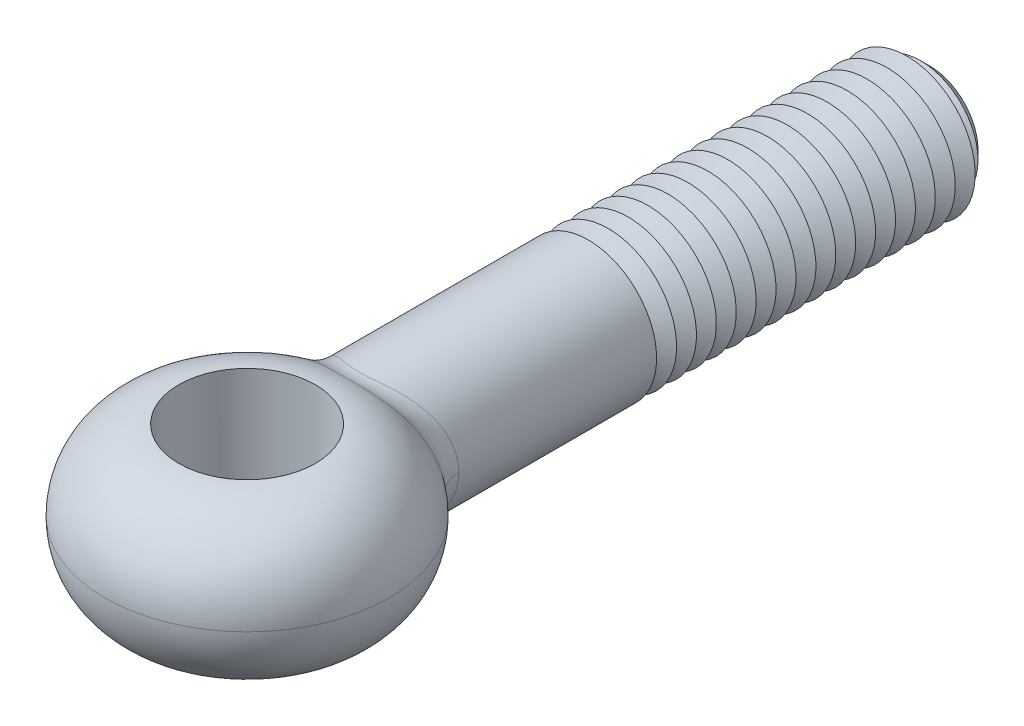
ISO-10303-21;
HEADER;
FILE_DESCRIPTION(('STEP AP214'),'2;1');
FILE_NAME('part.step','',(''),(''),'','','');
FILE_SCHEMA(('AUTOMOTIVE_DESIGN { 1 0 10303 214 1 1 1 1 }'));
ENDSEC;
DATA;
#1=APPLICATION_CONTEXT('core data for automotive mechanical design processes');
#2=APPLICATION_PROTOCOL_DEFINITION('international standard','automotive_design',2000,#1);
#3=PRODUCT_CONTEXT('',#1,'mechanical');
#4=PRODUCT('Part','Part','',(#3));
#5=PRODUCT_RELATED_PRODUCT_CATEGORY('part','',(#4));
#6=PRODUCT_DEFINITION_FORMATION('','',#4);
#7=PRODUCT_DEFINITION_CONTEXT('part definition',#1,'design');
#8=PRODUCT_DEFINITION('design','',#6,#7);
#9=PRODUCT_DEFINITION_SHAPE('','',#8);
#10=(LENGTH_UNIT() NAMED_UNIT(*) SI_UNIT(.MILLI.,.METRE.));
#11=(NAMED_UNIT(*) PLANE_ANGLE_UNIT() SI_UNIT($,.RADIAN.));
#12=(NAMED_UNIT(*) SI_UNIT($,.STERADIAN.) SOLID_ANGLE_UNIT());
#13=UNCERTAINTY_MEASURE_WITH_UNIT(LENGTH_MEASURE(1.E-05),#10,'distance_accuracy_value','');
#14=(GEOMETRIC_REPRESENTATION_CONTEXT(3) GLOBAL_UNCERTAINTY_ASSIGNED_CONTEXT((#13)) GLOBAL_UNIT_ASSIGNED_CONTEXT((#10,
#11,#12)) REPRESENTATION_CONTEXT('',''));
#15=CARTESIAN_POINT('',(0.,0.,0.));
#16=DIRECTION('',(0.,0.,1.));
#17=DIRECTION('',(1.,0.,0.));
#18=AXIS2_PLACEMENT_3D('',#15,#16,#17);
#19=CARTESIAN_POINT('',(0.,0.,-60.));
#20=DIRECTION('',(0.,0.,1.));
#21=DIRECTION('',(1.,0.,0.));
#22=AXIS2_PLACEMENT_3D('',#19,#20,#21);
#23=CYLINDRICAL_SURFACE('',#22,6.);
#24=CARTESIAN_POINT('',(0.,0.,-30.));
#25=DIRECTION('',(0.,0.,-1.));
#26=DIRECTION('',(-1.,0.,0.));
#27=AXIS2_PLACEMENT_3D('',#24,#25,#26);
#28=CIRCLE('',#27,6.);
#29=CARTESIAN_POINT('',(-6.,0.,-30.));
#30=VERTEX_POINT('',#29);
#31=EDGE_CURVE('E79',#30,#30,#28,.T.);
#32=ORIENTED_EDGE('',*,*,#31,.F.);
#33=EDGE_LOOP('',(#32));
#34=FACE_BOUND('',#33,.T.);
#35=CARTESIAN_POINT('',(5.9347688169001,-3.72936552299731,-9.76127797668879));
#36=CARTESIAN_POINT('',(5.01568840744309,-3.30684503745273,-10.6313747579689));
#37=CARTESIAN_POINT('',(4.83579180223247,-3.55177668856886,-11.9305846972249));
#38=CARTESIAN_POINT('',(6.04219931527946,-3.59564214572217,-9.79450956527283));
#39=CARTESIAN_POINT('',(5.09919553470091,-3.1795874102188,-10.6682119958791));
#40=CARTESIAN_POINT('',(4.92935060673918,-3.42442109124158,-11.9860495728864));
#41=CARTESIAN_POINT('',(6.1438473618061,-3.45763550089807,-9.82611020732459));
#42=CARTESIAN_POINT('',(5.17725322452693,-3.05002694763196,-10.702840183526));
#43=CARTESIAN_POINT('',(5.01812074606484,-3.29298619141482,-12.0386936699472));
#44=CARTESIAN_POINT('',(6.33498015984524,-3.17385997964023,-9.8857417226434));
#45=CARTESIAN_POINT('',(5.32290004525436,-2.78639390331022,-10.7677279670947));
#46=CARTESIAN_POINT('',(5.1853986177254,-3.02272379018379,-12.1378881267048));
#47=CARTESIAN_POINT('',(6.42446179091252,-3.02808912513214,-9.91377167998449));
#48=CARTESIAN_POINT('',(5.39041764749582,-2.65235488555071,-10.7979569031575));
#49=CARTESIAN_POINT('',(5.26390371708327,-2.88389440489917,-12.1844369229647));
#50=CARTESIAN_POINT('',(6.59063414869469,-2.72961135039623,-9.96594490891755));
#51=CARTESIAN_POINT('',(5.51491014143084,-2.38053035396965,-10.8538721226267));
#52=CARTESIAN_POINT('',(5.40994102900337,-2.5996298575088,-12.270973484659));
#53=CARTESIAN_POINT('',(6.66732079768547,-2.57690223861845,-9.99008694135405));
#54=CARTESIAN_POINT('',(5.57181683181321,-2.24279354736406,-10.8795284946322));
#55=CARTESIAN_POINT('',(5.47746974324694,-2.45419260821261,-12.3109591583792));
#56=CARTESIAN_POINT('',(6.80727548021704,-2.26566063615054,-10.0342164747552));
#57=CARTESIAN_POINT('',(5.67502497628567,-1.96438787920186,-10.9261769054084));
#58=CARTESIAN_POINT('',(5.60087770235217,-2.1577720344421,-12.3839763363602));
#59=CARTESIAN_POINT('',(6.87054514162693,-2.10712885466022,-10.0542044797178));
#60=CARTESIAN_POINT('',(5.72126980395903,-1.82378259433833,-10.9471437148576));
#61=CARTESIAN_POINT('',(5.65675836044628,-2.00678938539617,-12.4170086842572));
#62=CARTESIAN_POINT('',(7.03602672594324,-1.63406973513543,-10.1065323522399));
#63=CARTESIAN_POINT('',(5.84177866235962,-1.4066595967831,-11.0018788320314));
#64=CARTESIAN_POINT('',(5.80305576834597,-1.55625689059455,-12.5034220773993));
#65=CARTESIAN_POINT('',(7.11911563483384,-1.31267241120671,-10.1328771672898));
#66=CARTESIAN_POINT('',(5.90112324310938,-1.12766751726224,-11.0289752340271));
#67=CARTESIAN_POINT('',(5.87671572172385,-1.2501642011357,-12.5468355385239));
#68=CARTESIAN_POINT('',(7.23011866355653,-0.660856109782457,-10.1680856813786));
#69=CARTESIAN_POINT('',(5.98031743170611,-0.565466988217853,-11.0651706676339));
#70=CARTESIAN_POINT('',(5.97517391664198,-0.629386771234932,-12.6048310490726));
#71=CARTESIAN_POINT('',(7.25807152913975,-0.33044363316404,-10.1769616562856));
#72=CARTESIAN_POINT('',(6.00000388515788,-0.282923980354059,-11.0741952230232));
#73=CARTESIAN_POINT('',(6.0000064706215,-0.314708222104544,-12.6194333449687));
#74=CARTESIAN_POINT('',(7.25805738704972,0.335912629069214,-10.1769567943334));
#75=CARTESIAN_POINT('',(5.99999605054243,0.287606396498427,-11.0741911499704));
#76=CARTESIAN_POINT('',(5.99999342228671,0.319916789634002,-12.6194255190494));
#77=CARTESIAN_POINT('',(7.22915722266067,0.671857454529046,-10.1677796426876));
#78=CARTESIAN_POINT('',(5.97964504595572,0.574876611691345,-11.0648614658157));
#79=CARTESIAN_POINT('',(5.97431882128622,0.63986424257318,-12.6043279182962));
#80=CARTESIAN_POINT('',(7.11452740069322,1.33399050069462,-10.131423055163));
#81=CARTESIAN_POINT('',(5.89784251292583,1.14610230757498,-11.0274778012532));
#82=CARTESIAN_POINT('',(5.87264847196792,1.2704671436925,-12.5444393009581));
#83=CARTESIAN_POINT('',(7.02877559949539,1.66017486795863,-10.1042366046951));
#84=CARTESIAN_POINT('',(5.83657851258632,1.42936262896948,-10.9995093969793));
#85=CARTESIAN_POINT('',(5.79663311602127,1.58111892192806,-12.4996367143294));
#86=CARTESIAN_POINT('',(6.80343893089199,2.2930418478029,-10.0329875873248));
#87=CARTESIAN_POINT('',(5.67253761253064,1.98731296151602,-10.9250177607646));
#88=CARTESIAN_POINT('',(5.59744490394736,2.1838493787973,-12.3819651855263));
#89=CARTESIAN_POINT('',(6.66393326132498,2.59975238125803,-9.98894984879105));
#90=CARTESIAN_POINT('',(5.57019974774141,2.2614449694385,-10.8786920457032));
#91=CARTESIAN_POINT('',(5.47434142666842,2.47595464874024,-12.3091375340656));
#92=CARTESIAN_POINT('',(6.33535121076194,3.18625883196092,-9.88580293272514));
#93=CARTESIAN_POINT('',(5.32389744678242,2.79589244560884,-10.768093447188));
#94=CARTESIAN_POINT('',(5.18560859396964,3.03453222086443,-12.1380393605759));
#95=CARTESIAN_POINT('',(6.14627999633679,3.4660575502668,-9.82669532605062));
#96=CARTESIAN_POINT('',(5.18043230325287,3.05583228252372,-10.7040397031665));
#97=CARTESIAN_POINT('',(5.01998367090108,3.30100719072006,-12.0397714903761));
#98=CARTESIAN_POINT('',(5.7172577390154,4.00014270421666,-9.69400494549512));
#99=CARTESIAN_POINT('',(4.84766875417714,3.56284891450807,-10.5572649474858));
#100=CARTESIAN_POINT('',(4.64637499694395,3.8096597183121,-11.8183006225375));
#101=CARTESIAN_POINT('',(5.47601553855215,4.2534802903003,-9.62005911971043));
#102=CARTESIAN_POINT('',(4.65772328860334,3.80925143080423,-10.4742896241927));
#103=CARTESIAN_POINT('',(4.43732293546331,4.05093360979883,-11.694469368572));
#104=CARTESIAN_POINT('',(5.08259146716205,4.60342640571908,-9.50208552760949));
#105=CARTESIAN_POINT('',(4.34080391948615,4.15825147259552,-10.3388173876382));
#106=CARTESIAN_POINT('',(4.09924731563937,4.38421562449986,-11.4959320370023));
#107=CARTESIAN_POINT('',(4.9460782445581,4.71513594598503,-9.46155286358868));
#108=CARTESIAN_POINT('',(4.23020168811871,4.27084293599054,-10.2919789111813));
#109=CARTESIAN_POINT('',(3.98237779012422,4.49060566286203,-11.4275663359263));
#110=CARTESIAN_POINT('',(4.66296513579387,4.92813376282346,-9.37875537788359));
#111=CARTESIAN_POINT('',(3.99884628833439,4.48804462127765,-10.1953948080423));
#112=CARTESIAN_POINT('',(3.74115278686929,4.6934607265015,-11.2875507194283));
#113=CARTESIAN_POINT('',(4.5163679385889,5.0294247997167,-9.33649101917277));
#114=CARTESIAN_POINT('',(3.87815279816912,4.5926858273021,-10.1456674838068));
#115=CARTESIAN_POINT('',(3.61679930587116,4.78992838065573,-11.2159016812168));
#116=CARTESIAN_POINT('',(4.20225124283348,5.22831182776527,-9.24781094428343));
#117=CARTESIAN_POINT('',(3.61758964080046,4.80051594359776,-10.0403893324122));
#118=CARTESIAN_POINT('',(3.35180476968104,4.97934459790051,-11.0651470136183));
#119=CARTESIAN_POINT('',(4.03398632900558,5.3250780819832,-9.20131965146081));
#120=CARTESIAN_POINT('',(3.47696557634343,4.90311397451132,-9.98467073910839));
#121=CARTESIAN_POINT('',(3.21063957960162,5.07150293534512,-10.9858822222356));
#122=CARTESIAN_POINT('',(3.68652352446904,5.50578905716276,-9.10838168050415));
#123=CARTESIAN_POINT('',(3.18454628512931,5.09703954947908,-9.87225560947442));
#124=CARTESIAN_POINT('',(2.92111983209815,5.24360862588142,-10.8269291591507));
#125=CARTESIAN_POINT('',(3.50732357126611,5.5897313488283,-9.06193501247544));
#126=CARTESIAN_POINT('',(3.03278104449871,5.18843564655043,-9.81555489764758));
#127=CARTESIAN_POINT('',(2.77276391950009,5.32355366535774,-10.7472408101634));
#128=CARTESIAN_POINT('',(3.13794087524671,5.74446425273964,-8.97062224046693));
#129=CARTESIAN_POINT('',(2.71821702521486,5.35884982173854,-9.70314483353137));
#130=CARTESIAN_POINT('',(2.46931336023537,5.47091833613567,-10.5900722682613));
#131=CARTESIAN_POINT('',(2.94775184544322,5.81524723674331,-8.92575706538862));
#132=CARTESIAN_POINT('',(2.55541416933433,5.43794512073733,-9.64741385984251));
#133=CARTESIAN_POINT('',(2.31421486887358,5.53833070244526,-10.5125933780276));
#134=CARTESIAN_POINT('',(2.55657851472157,5.9431564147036,-8.83975050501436));
#135=CARTESIAN_POINT('',(2.21925064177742,5.58238081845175,-9.53980556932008));
#136=CARTESIAN_POINT('',(1.99786735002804,5.66014896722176,-10.3636052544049));
#137=CARTESIAN_POINT('',(2.35559801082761,6.00028737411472,-8.79860782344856));
#138=CARTESIAN_POINT('',(2.04585622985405,5.64781946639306,-9.48788433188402));
#139=CARTESIAN_POINT('',(1.83662049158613,5.71455940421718,-10.2920939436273));
#140=CARTESIAN_POINT('',(1.85774191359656,6.12093796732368,-8.70719486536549));
#141=CARTESIAN_POINT('',(1.61559271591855,5.78713197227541,-9.37194513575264));
#142=CARTESIAN_POINT('',(1.4406271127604,5.82946473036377,-10.1327613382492));
#143=CARTESIAN_POINT('',(1.55532271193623,6.17747996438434,-8.6600942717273));
#144=CARTESIAN_POINT('',(1.3529723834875,5.8538439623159,-9.31142342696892));
#145=CARTESIAN_POINT('',(1.20284157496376,5.88331425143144,-10.0502669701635));
#146=CARTESIAN_POINT('',(1.0891409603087,6.23930337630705,-8.60649289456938));
#147=CARTESIAN_POINT('',(0.947579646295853,5.92726352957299,-9.242285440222));
#148=CARTESIAN_POINT('',(0.83982684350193,5.94219369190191,-9.95617208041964));
#149=CARTESIAN_POINT('',(0.931962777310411,6.25606948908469,-8.59147969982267));
#150=CARTESIAN_POINT('',(0.810874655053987,5.94729550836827,-9.22285403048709));
#151=CARTESIAN_POINT('',(0.718001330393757,5.95816141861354,-9.92977025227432));
#152=CARTESIAN_POINT('',(0.614462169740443,6.2817502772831,-8.56819097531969));
#153=CARTESIAN_POINT('',(0.534722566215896,5.97803723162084,-9.19268813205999));
#154=CARTESIAN_POINT('',(0.472694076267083,5.98261931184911,-9.88878715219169));
#155=CARTESIAN_POINT('',(0.454140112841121,6.29066586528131,-8.5599146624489));
#156=CARTESIAN_POINT('',(0.395193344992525,5.98876738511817,-9.18193414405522));
#157=CARTESIAN_POINT('',(0.349212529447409,5.9911103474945,-9.87420450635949));
#158=CARTESIAN_POINT('',(0.131049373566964,6.30047562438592,-8.55079683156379));
#159=CARTESIAN_POINT('',(0.114068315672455,6.00056854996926,-9.17009294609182));
#160=CARTESIAN_POINT('',(0.100687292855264,6.00045297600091,-9.85813795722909));
#161=CARTESIAN_POINT('',(-0.0317286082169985,6.30131187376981,-8.55000899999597));
#162=CARTESIAN_POINT('',(-0.0276309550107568,6.00157787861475,-9.16906745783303));
#163=CARTESIAN_POINT('',(-0.02436125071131,6.00124940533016,-9.85674863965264));
#164=CARTESIAN_POINT('',(-0.356412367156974,6.29479284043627,-8.55608280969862));
#165=CARTESIAN_POINT('',(-0.31015318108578,5.99373179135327,-9.1769575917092));
#166=CARTESIAN_POINT('',(-0.274003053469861,5.9950408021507,-9.86745275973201));
#167=CARTESIAN_POINT('',(-0.518318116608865,6.28743729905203,-8.56294469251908));
#168=CARTESIAN_POINT('',(-0.451073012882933,5.98487067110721,-9.18587895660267));
#169=CARTESIAN_POINT('',(-0.398596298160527,5.98803552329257,-9.87954662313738));
#170=CARTESIAN_POINT('',(-0.839832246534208,6.26466677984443,-8.583729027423));
#171=CARTESIAN_POINT('',(-0.730746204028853,5.95757663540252,-9.21281914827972));
#172=CARTESIAN_POINT('',(-0.646718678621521,5.96634931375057,-9.91613502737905));
#173=CARTESIAN_POINT('',(-0.999430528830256,6.24922351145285,-8.59767625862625));
#174=CARTESIAN_POINT('',(-0.869577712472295,5.93909230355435,-9.23088715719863));
#175=CARTESIAN_POINT('',(-0.770242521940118,5.95164143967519,-9.94067308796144));
#176=CARTESIAN_POINT('',(-1.31437481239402,6.21055073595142,-8.63153922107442));
#177=CARTESIAN_POINT('',(-1.14330359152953,5.89311724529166,-9.27458059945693));
#178=CARTESIAN_POINT('',(-1.01506554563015,5.91481022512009,-10.0001513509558));
#179=CARTESIAN_POINT('',(-1.46971907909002,6.18731810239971,-8.65145734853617));
#180=CARTESIAN_POINT('',(-1.27826760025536,5.86559591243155,-9.30023316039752));
#181=CARTESIAN_POINT('',(-1.13636381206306,5.89268390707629,-10.0350957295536));
#182=CARTESIAN_POINT('',(-1.82539603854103,6.12454062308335,-8.70327656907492));
#183=CARTESIAN_POINT('',(-1.58698911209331,5.79180104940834,-9.36667644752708));
#184=CARTESIAN_POINT('',(-1.41557604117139,5.83289583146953,-10.1258248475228));
#185=CARTESIAN_POINT('',(-2.02378988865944,6.08214516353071,-8.73696553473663));
#186=CARTESIAN_POINT('',(-1.75893471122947,5.74230420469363,-9.40969592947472));
#187=CARTESIAN_POINT('',(-1.57246341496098,5.79251920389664,-10.184686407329));
#188=CARTESIAN_POINT('',(-2.41092164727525,5.98480792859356,-8.80979727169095));
#189=CARTESIAN_POINT('',(-2.09355200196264,5.63009686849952,-9.50199744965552));
#190=CARTESIAN_POINT('',(-1.880970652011,5.69981707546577,-10.3115469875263));
#191=CARTESIAN_POINT('',(-2.5996560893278,5.92986168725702,-8.84894198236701));
#192=CARTESIAN_POINT('',(-2.25629041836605,5.56730096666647,-9.55133195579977));
#193=CARTESIAN_POINT('',(-2.03258861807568,5.64748732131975,-10.3795492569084));
#194=CARTESIAN_POINT('',(-2.96755778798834,5.80783248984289,-8.93044371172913));
#195=CARTESIAN_POINT('',(-2.57232712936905,5.42968443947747,-9.65322105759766));
#196=CARTESIAN_POINT('',(-2.33036981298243,5.53126903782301,-10.5206862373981));
#197=CARTESIAN_POINT('',(-3.14671697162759,5.74073949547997,-8.97280337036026));
#198=CARTESIAN_POINT('',(-2.72564626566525,5.35477585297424,-9.70581299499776));
#199=CARTESIAN_POINT('',(-2.47652840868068,5.46737094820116,-10.593825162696));
#200=CARTESIAN_POINT('',(-3.49533769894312,5.59480022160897,-9.05896053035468));
#201=CARTESIAN_POINT('',(-3.02253770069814,5.19403391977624,-9.81188119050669));
#202=CARTESIAN_POINT('',(-2.76291205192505,5.32838116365,-10.742122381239));
#203=CARTESIAN_POINT('',(-3.66480050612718,5.51595547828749,-9.10275784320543));
#204=CARTESIAN_POINT('',(-3.16610934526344,5.10813119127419,-9.86537600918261));
#205=CARTESIAN_POINT('',(-2.90313787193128,5.2532909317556,-10.8172804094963));
#206=CARTESIAN_POINT('',(-3.99928684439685,5.34409495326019,-9.19187849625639));
#207=CARTESIAN_POINT('',(-3.44784552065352,4.92340384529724,-9.97329692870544));
#208=CARTESIAN_POINT('',(-3.18162491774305,5.08961424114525,-10.9697608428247));
#209=CARTESIAN_POINT('',(-4.16399459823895,5.25070632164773,-9.23720580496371));
#210=CARTESIAN_POINT('',(-3.58564022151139,4.82420269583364,-10.027694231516));
#211=CARTESIAN_POINT('',(-3.31967954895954,5.00067268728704,-11.0470755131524));
#212=CARTESIAN_POINT('',(-4.48282170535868,5.05207061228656,-9.32687019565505));
#213=CARTESIAN_POINT('',(-3.85050097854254,4.61613017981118,-10.1343299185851));
#214=CARTESIAN_POINT('',(-3.58838451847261,4.8114958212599,-11.1995795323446));
#215=CARTESIAN_POINT('',(-4.63694077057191,4.94682321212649,-9.37120725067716));
#216=CARTESIAN_POINT('',(-3.97751767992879,4.50720729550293,-10.1865592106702));
#217=CARTESIAN_POINT('',(-3.71903465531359,4.71126020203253,-11.2747688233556));
#218=CARTESIAN_POINT('',(-4.93402321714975,4.72498798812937,-9.45797232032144));
#219=CARTESIAN_POINT('',(-4.22045615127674,4.28075328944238,-10.2878502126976));
#220=CARTESIAN_POINT('',(-3.97205735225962,4.49998856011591,-11.421526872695));
#221=CARTESIAN_POINT('',(-5.0769962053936,4.60841012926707,-9.50040196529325));
#222=CARTESIAN_POINT('',(-4.33632375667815,4.16319510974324,-10.3368953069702));
#223=CARTESIAN_POINT('',(-4.09443702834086,4.38896202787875,-11.4930987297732));
#224=CARTESIAN_POINT('',(-5.35139946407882,4.36431803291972,-9.58269705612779));
#225=CARTESIAN_POINT('',(-4.55686646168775,3.92030762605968,-10.4311837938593));
#226=CARTESIAN_POINT('',(-4.3302405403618,4.15649336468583,-11.6315929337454));
#227=CARTESIAN_POINT('',(-5.48282554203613,4.2367998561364,-9.62256156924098));
#228=CARTESIAN_POINT('',(-4.66146230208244,3.79496029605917,-10.476398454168));
#229=CARTESIAN_POINT('',(-4.44366112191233,4.03504748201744,-11.6985135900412));
#230=CARTESIAN_POINT('',(-5.73992249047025,3.96459248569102,-9.70111653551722));
#231=CARTESIAN_POINT('',(-4.86435688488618,3.53075699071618,-10.5647509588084));
#232=CARTESIAN_POINT('',(-4.66626199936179,3.77580236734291,-11.8301121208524));
#233=CARTESIAN_POINT('',(-5.86493730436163,3.81935492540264,-9.73963775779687));
#234=CARTESIAN_POINT('',(-4.96192595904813,3.39157605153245,-10.6076101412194));
#235=CARTESIAN_POINT('',(-4.77491394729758,3.6374808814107,-11.894491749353));
#236=CARTESIAN_POINT('',(-6.10049317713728,3.5184514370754,-9.81259595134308));
#237=CARTESIAN_POINT('',(-5.14414695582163,3.10685040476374,-10.6881097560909));
#238=CARTESIAN_POINT('',(-4.98021019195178,3.35090613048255,-12.0161983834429));
#239=CARTESIAN_POINT('',(-6.21103492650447,3.36278600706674,-9.84703311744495));
#240=CARTESIAN_POINT('',(-5.22870245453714,2.96133570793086,-10.7257098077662));
#241=CARTESIAN_POINT('',(-5.07685506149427,3.20265333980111,-12.0735257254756));
#242=CARTESIAN_POINT('',(-6.41684087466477,3.04200182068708,-9.91136789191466));
#243=CARTESIAN_POINT('',(-5.38481615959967,2.66492089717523,-10.7954268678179));
#244=CARTESIAN_POINT('',(-5.25718892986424,2.89714459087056,-12.1804567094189));
#245=CARTESIAN_POINT('',(-6.51209487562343,2.87687685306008,-9.941262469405));
#246=CARTESIAN_POINT('',(-5.45627120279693,2.51407150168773,-10.8274993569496));
#247=CARTESIAN_POINT('',(-5.34086927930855,2.73988271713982,-12.230055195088));
#248=CARTESIAN_POINT('',(-6.68634060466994,2.53862818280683,-9.99606907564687));
#249=CARTESIAN_POINT('',(-5.58600966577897,2.20820283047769,-10.8859198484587));
#250=CARTESIAN_POINT('',(-5.49420876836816,2.41774112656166,-12.3208709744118));
#251=CARTESIAN_POINT('',(-6.7653416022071,2.365509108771,-10.0209839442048));
#252=CARTESIAN_POINT('',(-5.64421437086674,2.05326176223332,-10.9122330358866));
#253=CARTESIAN_POINT('',(-5.56387589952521,2.25286581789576,-12.3620930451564));
#254=CARTESIAN_POINT('',(-6.90530331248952,2.01532499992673,-10.0651851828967));
#255=CARTESIAN_POINT('',(-5.7466982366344,1.74251049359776,-10.9586742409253));
#256=CARTESIAN_POINT('',(-5.68746016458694,1.91935714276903,-12.4351539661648));
#257=CARTESIAN_POINT('',(-6.96652294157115,1.83836168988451,-10.0845522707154));
#258=CARTESIAN_POINT('',(-5.79110883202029,1.58683531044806,-10.9788602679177));
#259=CARTESIAN_POINT('',(-5.74160317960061,1.75082065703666,-12.4671274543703));
#260=CARTESIAN_POINT('',(-7.07189656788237,1.47955191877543,-10.1179144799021));
#261=CARTESIAN_POINT('',(-5.86721134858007,1.27322299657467,-11.0135080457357));
#262=CARTESIAN_POINT('',(-5.83487815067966,1.40909706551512,-12.5221684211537));
#263=CARTESIAN_POINT('',(-7.11605858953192,1.29770779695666,-10.1319121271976));
#264=CARTESIAN_POINT('',(-5.89885329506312,1.11539297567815,-11.02794716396));
#265=CARTESIAN_POINT('',(-5.87401716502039,1.2359121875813,-12.5452400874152));
#266=CARTESIAN_POINT('',(-7.18688145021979,0.930719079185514,-10.1543694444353));
#267=CARTESIAN_POINT('',(-5.9494736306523,0.79823853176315,-11.0510690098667));
#268=CARTESIAN_POINT('',(-5.93681662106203,0.886399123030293,-12.5822406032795));
#269=CARTESIAN_POINT('',(-7.21355030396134,0.745576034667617,-10.1628316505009));
#270=CARTESIAN_POINT('',(-5.9684191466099,0.639031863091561,-11.0597367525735));
#271=CARTESIAN_POINT('',(-5.96048415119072,0.710072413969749,-12.5961736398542));
#272=CARTESIAN_POINT('',(-7.24914599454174,0.373651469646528,-10.1741279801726));
#273=CARTESIAN_POINT('',(-5.99369065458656,0.319847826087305,-11.0713030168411));
#274=CARTESIAN_POINT('',(-5.99208005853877,0.355858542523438,-12.6147701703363));
#275=CARTESIAN_POINT('',(-7.25807450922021,0.186870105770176,-10.1769626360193));
#276=CARTESIAN_POINT('',(-5.999998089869,0.159994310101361,-11.074193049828));
#277=CARTESIAN_POINT('',(-6.00000992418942,0.17797152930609,-12.6194345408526));
#278=CARTESIAN_POINT('',(-7.25804656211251,-0.335738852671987,-10.1769531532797));
#279=CARTESIAN_POINT('',(-6.0000034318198,-0.287452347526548,-11.0741934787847));
#280=CARTESIAN_POINT('',(-5.99998216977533,-0.31975128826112,-12.6194203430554));
#281=CARTESIAN_POINT('',(-7.22917576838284,-0.671764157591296,-10.1677860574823));
#282=CARTESIAN_POINT('',(-5.97966209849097,-0.574787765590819,-11.0648695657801));
#283=CARTESIAN_POINT('',(-5.97433528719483,-0.639775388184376,-12.6043385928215));
#284=CARTESIAN_POINT('',(-7.1145105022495,-1.33407428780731,-10.1314171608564));
#285=CARTESIAN_POINT('',(-5.8978267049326,-1.14618252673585,-11.0274702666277));
#286=CARTESIAN_POINT('',(-5.8726334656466,-1.27054694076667,-12.5444294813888));
#287=CARTESIAN_POINT('',(-7.02869303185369,-1.66035512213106,-10.1042080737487));
#288=CARTESIAN_POINT('',(-5.83651996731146,-1.42954497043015,-10.999480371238));
#289=CARTESIAN_POINT('',(-5.79655816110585,-1.58129059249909,-12.4995901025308));
#290=CARTESIAN_POINT('',(-6.85971870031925,-2.13500368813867,-10.0507838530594));
#291=CARTESIAN_POINT('',(-5.71335936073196,-1.84847480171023,-10.9435562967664));
#292=CARTESIAN_POINT('',(-5.64719485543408,-2.03333684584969,-12.411356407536));
#293=CARTESIAN_POINT('',(-6.79670689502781,-2.29072029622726,-10.0308806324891));
#294=CARTESIAN_POINT('',(-5.66726413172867,-1.98670630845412,-10.9226633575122));
#295=CARTESIAN_POINT('',(-5.59155053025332,-2.18163837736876,-12.3784603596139));
#296=CARTESIAN_POINT('',(-6.65771758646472,-2.59645969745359,-9.98706290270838));
#297=CARTESIAN_POINT('',(-5.56469443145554,-2.26041067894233,-10.8763159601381));
#298=CARTESIAN_POINT('',(-5.46901133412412,-2.47281875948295,-12.3059514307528));
#299=CARTESIAN_POINT('',(-6.58173903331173,-2.74648202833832,-9.96314806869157));
#300=CARTESIAN_POINT('',(-5.50827469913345,-2.395823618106,-10.8508858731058));
#301=CARTESIAN_POINT('',(-5.40211555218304,-2.61569716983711,-12.2663380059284));
#302=CARTESIAN_POINT('',(-6.41741234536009,-3.03976673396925,-9.91156293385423));
#303=CARTESIAN_POINT('',(-5.38510014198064,-2.6630812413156,-10.7955752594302));
#304=CARTESIAN_POINT('',(-5.25771751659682,-2.89501593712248,-12.180769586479));
#305=CARTESIAN_POINT('',(-6.32906900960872,-3.18303170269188,-9.88389409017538));
#306=CARTESIAN_POINT('',(-5.3184112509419,-2.79488018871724,-10.7657236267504));
#307=CARTESIAN_POINT('',(-5.18021937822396,-3.03145876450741,-12.1348170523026));
#308=CARTESIAN_POINT('',(-6.14060484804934,-3.46203414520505,-9.82510194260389));
#309=CARTESIAN_POINT('',(-5.17475790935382,-3.05416625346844,-10.7017329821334));
#310=CARTESIAN_POINT('',(-5.01528894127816,-3.29717537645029,-12.0370139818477));
#311=CARTESIAN_POINT('',(-6.0404865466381,-3.5977732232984,-9.79397937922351));
#312=CARTESIAN_POINT('',(-5.09786126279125,-3.18162147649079,-10.6676230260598));
#313=CARTESIAN_POINT('',(-4.92785877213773,-3.42645068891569,-11.9851647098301));
#314=CARTESIAN_POINT('',(-5.9347688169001,-3.72936552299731,-9.76127797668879));
#315=CARTESIAN_POINT('',(-5.01568840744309,-3.30684503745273,-10.6313747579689));
#316=CARTESIAN_POINT('',(-4.83579180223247,-3.55177668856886,-11.9305846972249));
#317=(BOUNDED_SURFACE() B_SPLINE_SURFACE(3,2,((#35,#36,#37),(#38,#39,#40),(#41,#42,#43),(#44,
#45,#46),(#47,#48,#49),(#50,#51,#52),(#53,#54,#55),(#56,#57,#58),(#59,#60,#61),(#62,#63,#64),
(#65,#66,#67),(#68,#69,#70),(#71,#72,#73),(#74,#75,#76),(#77,#78,#79),(#80,#81,#82),(#83,#84,
#85),(#86,#87,#88),(#89,#90,#91),(#92,#93,#94),(#95,#96,#97),(#98,#99,#100),(#101,#102,#103),
(#104,#105,#106),(#107,#108,#109),(#110,#111,#112),(#113,#114,#115),(#116,#117,#118),(#119,#120,
#121),(#122,#123,#124),(#125,#126,#127),(#128,#129,#130),(#131,#132,#133),(#134,#135,#136),
(#137,#138,#139),(#140,#141,#142),(#143,#144,#145),(#146,#147,#148),(#149,#150,#151),(#152,#153,
#154),(#155,#156,#157),(#158,#159,#160),(#161,#162,#163),(#164,#165,#166),(#167,#168,#169),
(#170,#171,#172),(#173,#174,#175),(#176,#177,#178),(#179,#180,#181),(#182,#183,#184),(#185,#186,
#187),(#188,#189,#190),(#191,#192,#193),(#194,#195,#196),(#197,#198,#199),(#200,#201,#202),
(#203,#204,#205),(#206,#207,#208),(#209,#210,#211),(#212,#213,#214),(#215,#216,#217),(#218,#219,
#220),(#221,#222,#223),(#224,#225,#226),(#227,#228,#229),(#230,#231,#232),(#233,#234,#235),
(#236,#237,#238),(#239,#240,#241),(#242,#243,#244),(#245,#246,#247),(#248,#249,#250),(#251,#252,
#253),(#254,#255,#256),(#257,#258,#259),(#260,#261,#262),(#263,#264,#265),(#266,#267,#268),
(#269,#270,#271),(#272,#273,#274),(#275,#276,#277),(#278,#279,#280),(#281,#282,#283),(#284,#285,
#286),(#287,#288,#289),(#290,#291,#292),(#293,#294,#295),(#296,#297,#298),(#299,#300,#301),
(#302,#303,#304),(#305,#306,#307),(#308,#309,#310),(#311,#312,#313),(#314,#315,#316)),
.UNSPECIFIED.,.F.,.F.,.F.) B_SPLINE_SURFACE_WITH_KNOTS((4,2,2,2,2,2,2,2,2,2,2,2,2,2,2,2,2,2,2,2,
2,2,2,2,2,2,2,2,2,2,2,2,2,2,2,2,2,2,2,2,2,2,2,2,2,2,4),(3,3),(0.,0.730157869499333,
1.46050265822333,2.19107976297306,2.92156817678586,4.33710286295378,5.75164245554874,
7.18959333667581,8.62810462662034,10.0645045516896,11.5007548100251,12.9777469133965,
13.7173286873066,14.4567140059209,15.2508784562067,16.0451931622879,16.8399668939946,
17.6344627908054,18.7545699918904,19.3125249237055,19.8704149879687,20.4323016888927,
20.9942061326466,21.5580893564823,22.1221991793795,22.8711633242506,23.6203943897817,
24.3702474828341,25.1200026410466,25.8937593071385,26.6675370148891,27.440640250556,
28.214023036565,29.0276778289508,29.8412937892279,30.6554502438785,31.4691410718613,
32.2703098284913,33.0711012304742,33.8715254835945,34.6718740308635,36.109814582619,
37.5483362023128,38.2672339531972,38.986189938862,39.7048676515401,40.4233915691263),(0.,1.),
.UNSPECIFIED.) GEOMETRIC_REPRESENTATION_ITEM() RATIONAL_B_SPLINE_SURFACE(((1.,0.913704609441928,
1.),(1.,0.911808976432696,1.),(1.,0.909987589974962,1.),(1.,0.906521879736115,1.),(1.,
0.904877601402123,1.),(1.,0.901795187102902,1.),(1.,0.900357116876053,1.),(1.,0.897712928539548,
1.),(1.,0.896506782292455,1.),(1.,0.893335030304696,1.),(1.,0.891717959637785,1.),(1.,
0.889551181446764,1.),(1.,0.889000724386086,1.),(1.,0.88900105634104,1.),(1.,0.889570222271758,
1.),(1.,0.891807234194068,1.),(1.,0.893475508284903,1.),(1.,0.897791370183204,1.),(1.,
0.900437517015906,1.),(1.,0.90652846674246,1.),(1.,0.909973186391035,1.),(1.,0.917541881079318,
1.),(1.,0.921682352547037,1.),(1.,0.928122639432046,1.),(1.,0.930309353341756,1.),(1.,
0.934718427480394,1.),(1.,0.936940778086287,1.),(1.,0.941540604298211,1.),(1.,0.943917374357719,
1.),(1.,0.948597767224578,1.),(1.,0.9509013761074,1.),(1.,0.955362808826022,1.),(1.,
0.957520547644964,1.),(1.,0.961598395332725,1.),(1.,0.963518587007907,1.),(1.,0.967731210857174,
1.),(1.,0.969853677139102,1.),(1.,0.972244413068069,1.),(1.,0.972908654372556,1.),(1.,
0.973935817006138,1.),(1.,0.97429877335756,1.),(1.,0.974698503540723,1.),(1.,0.974732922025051,
1.),(1.,0.974466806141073,1.),(1.,0.974166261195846,1.),(1.,0.973250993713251,1.),(1.,
0.972635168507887,1.),(1.,0.9711286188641,1.),(1.,0.970237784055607,1.),(1.,0.967898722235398,
1.),(1.,0.966363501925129,1.),(1.,0.962996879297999,1.),(1.,0.961165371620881,1.),(1.,
0.957295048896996,1.),(1.,0.955256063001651,1.),(1.,0.951046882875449,1.),(1.,0.948876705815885,
1.),(1.,0.944396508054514,1.),(1.,0.942084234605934,1.),(1.,0.937444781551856,1.),(1.,
0.935117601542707,1.),(1.,0.93050246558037,1.),(1.,0.928214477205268,1.),(1.,0.923722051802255,
1.),(1.,0.921517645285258,1.),(1.,0.917125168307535,1.),(1.,0.914943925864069,1.),(1.,
0.910769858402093,1.),(1.,0.90877702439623,1.),(1.,0.905020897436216,1.),(1.,0.903257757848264,
1.),(1.,0.900001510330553,1.),(1.,0.898508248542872,1.),(1.,0.895843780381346,1.),(1.,
0.894667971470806,1.),(1.,0.892634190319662,1.),(1.,0.891776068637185,1.),(1.,0.890395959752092,
1.),(1.,0.889873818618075,1.),(1.,0.889176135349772,1.),(1.,0.889000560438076,1.),(1.,
0.889001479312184,1.),(1.,0.889569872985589,1.),(1.,0.89180755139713,1.),(1.,0.893477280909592,
1.),(1.,0.896713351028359,1.),(1.,0.897913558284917,1.),(1.,0.900537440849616,1.),(1.,
0.901961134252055,1.),(1.,0.905007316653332,1.),(1.,0.906629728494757,1.),(1.,0.910045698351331,
1.),(1.,0.911839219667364,1.),(1.,0.913704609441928,1.))) REPRESENTATION_ITEM('') SURFACE());
#318=CARTESIAN_POINT('',(-4.83579180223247,-3.55177668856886,-11.9305846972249));
#319=CARTESIAN_POINT('',(-4.92785877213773,-3.42645068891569,-11.9851647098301));
#320=CARTESIAN_POINT('',(-5.01528894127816,-3.29717537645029,-12.0370139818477));
#321=CARTESIAN_POINT('',(-5.18021937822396,-3.03145876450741,-12.1348170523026));
#322=CARTESIAN_POINT('',(-5.25771751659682,-2.89501593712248,-12.180769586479));
#323=CARTESIAN_POINT('',(-5.40211555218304,-2.61569716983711,-12.2663380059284));
#324=CARTESIAN_POINT('',(-5.46901133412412,-2.47281875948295,-12.3059514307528));
#325=CARTESIAN_POINT('',(-5.59155053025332,-2.18163837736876,-12.3784603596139));
#326=CARTESIAN_POINT('',(-5.64719485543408,-2.03333684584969,-12.411356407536));
#327=CARTESIAN_POINT('',(-5.79655816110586,-1.5812905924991,-12.4995901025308));
#328=CARTESIAN_POINT('',(-5.8726334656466,-1.27054694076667,-12.5444294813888));
#329=CARTESIAN_POINT('',(-5.97433528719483,-0.639775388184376,-12.6043385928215));
#330=CARTESIAN_POINT('',(-5.99998216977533,-0.31975128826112,-12.6194203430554));
#331=CARTESIAN_POINT('',(-6.00000992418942,0.17797152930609,-12.6194345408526));
#332=CARTESIAN_POINT('',(-5.99208005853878,0.355858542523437,-12.6147701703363));
#333=CARTESIAN_POINT('',(-5.96048415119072,0.71007241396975,-12.5961736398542));
#334=CARTESIAN_POINT('',(-5.93681662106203,0.886399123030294,-12.5822406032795));
#335=CARTESIAN_POINT('',(-5.87401716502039,1.2359121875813,-12.5452400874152));
#336=CARTESIAN_POINT('',(-5.83487815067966,1.40909706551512,-12.5221684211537));
#337=CARTESIAN_POINT('',(-5.74160317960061,1.75082065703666,-12.4671274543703));
#338=CARTESIAN_POINT('',(-5.68746016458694,1.91935714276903,-12.4351539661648));
#339=CARTESIAN_POINT('',(-5.56387589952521,2.25286581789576,-12.3620930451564));
#340=CARTESIAN_POINT('',(-5.49420876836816,2.41774112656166,-12.3208709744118));
#341=CARTESIAN_POINT('',(-5.34086927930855,2.73988271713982,-12.230055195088));
#342=CARTESIAN_POINT('',(-5.25718892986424,2.89714459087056,-12.1804567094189));
#343=CARTESIAN_POINT('',(-5.07685506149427,3.20265333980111,-12.0735257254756));
#344=CARTESIAN_POINT('',(-4.98021019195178,3.35090613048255,-12.0161983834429));
#345=CARTESIAN_POINT('',(-4.77491394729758,3.6374808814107,-11.894491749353));
#346=CARTESIAN_POINT('',(-4.66626199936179,3.77580236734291,-11.8301121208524));
#347=CARTESIAN_POINT('',(-4.44366112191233,4.03504748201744,-11.6985135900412));
#348=CARTESIAN_POINT('',(-4.3302405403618,4.15649336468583,-11.6315929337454));
#349=CARTESIAN_POINT('',(-4.09443702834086,4.38896202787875,-11.4930987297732));
#350=CARTESIAN_POINT('',(-3.97205735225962,4.49998856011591,-11.421526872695));
#351=CARTESIAN_POINT('',(-3.71903465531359,4.71126020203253,-11.2747688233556));
#352=CARTESIAN_POINT('',(-3.58838451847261,4.8114958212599,-11.1995795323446));
#353=CARTESIAN_POINT('',(-3.31967954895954,5.00067268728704,-11.0470755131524));
#354=CARTESIAN_POINT('',(-3.18162491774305,5.08961424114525,-10.9697608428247));
#355=CARTESIAN_POINT('',(-2.90313787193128,5.2532909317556,-10.8172804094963));
#356=CARTESIAN_POINT('',(-2.76291205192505,5.32838116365,-10.742122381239));
#357=CARTESIAN_POINT('',(-2.47652840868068,5.46737094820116,-10.593825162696));
#358=CARTESIAN_POINT('',(-2.33036981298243,5.53126903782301,-10.5206862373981));
#359=CARTESIAN_POINT('',(-2.03258861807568,5.64748732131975,-10.3795492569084));
#360=CARTESIAN_POINT('',(-1.880970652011,5.69981707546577,-10.3115469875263));
#361=CARTESIAN_POINT('',(-1.57246341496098,5.79251920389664,-10.184686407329));
#362=CARTESIAN_POINT('',(-1.41557604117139,5.83289583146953,-10.1258248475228));
#363=CARTESIAN_POINT('',(-1.13636381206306,5.89268390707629,-10.0350957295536));
#364=CARTESIAN_POINT('',(-1.01506554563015,5.91481022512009,-10.0001513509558));
#365=CARTESIAN_POINT('',(-0.770242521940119,5.95164143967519,-9.94067308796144));
#366=CARTESIAN_POINT('',(-0.64671867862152,5.96634931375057,-9.91613502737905));
#367=CARTESIAN_POINT('',(-0.398596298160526,5.98803552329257,-9.87954662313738));
#368=CARTESIAN_POINT('',(-0.274003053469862,5.9950408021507,-9.86745275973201));
#369=CARTESIAN_POINT('',(-0.0243612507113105,6.00124940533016,-9.85674863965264));
#370=CARTESIAN_POINT('',(0.100687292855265,6.00045297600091,-9.85813795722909));
#371=CARTESIAN_POINT('',(0.34921252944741,5.9911103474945,-9.87420450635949));
#372=CARTESIAN_POINT('',(0.472694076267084,5.98261931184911,-9.88878715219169));
#373=CARTESIAN_POINT('',(0.718001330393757,5.95816141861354,-9.92977025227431));
#374=CARTESIAN_POINT('',(0.83982684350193,5.94219369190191,-9.95617208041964));
#375=CARTESIAN_POINT('',(1.20284157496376,5.88331425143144,-10.0502669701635));
#376=CARTESIAN_POINT('',(1.4406271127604,5.82946473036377,-10.1327613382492));
#377=CARTESIAN_POINT('',(1.83662049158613,5.71455940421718,-10.2920939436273));
#378=CARTESIAN_POINT('',(1.99786735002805,5.66014896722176,-10.3636052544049));
#379=CARTESIAN_POINT('',(2.31421486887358,5.53833070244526,-10.5125933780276));
#380=CARTESIAN_POINT('',(2.46931336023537,5.47091833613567,-10.5900722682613));
#381=CARTESIAN_POINT('',(2.77276391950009,5.32355366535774,-10.7472408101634));
#382=CARTESIAN_POINT('',(2.92111983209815,5.24360862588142,-10.8269291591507));
#383=CARTESIAN_POINT('',(3.21063957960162,5.07150293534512,-10.9858822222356));
#384=CARTESIAN_POINT('',(3.35180476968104,4.97934459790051,-11.0651470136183));
#385=CARTESIAN_POINT('',(3.61679930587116,4.78992838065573,-11.2159016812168));
#386=CARTESIAN_POINT('',(3.74115278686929,4.6934607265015,-11.2875507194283));
#387=CARTESIAN_POINT('',(3.98237779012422,4.49060566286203,-11.4275663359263));
#388=CARTESIAN_POINT('',(4.09924731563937,4.38421562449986,-11.4959320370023));
#389=CARTESIAN_POINT('',(4.43732293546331,4.05093360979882,-11.694469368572));
#390=CARTESIAN_POINT('',(4.64637499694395,3.8096597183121,-11.8183006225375));
#391=CARTESIAN_POINT('',(5.01998367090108,3.30100719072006,-12.0397714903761));
#392=CARTESIAN_POINT('',(5.18560859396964,3.03453222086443,-12.1380393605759));
#393=CARTESIAN_POINT('',(5.47434142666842,2.47595464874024,-12.3091375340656));
#394=CARTESIAN_POINT('',(5.59744490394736,2.1838493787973,-12.3819651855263));
#395=CARTESIAN_POINT('',(5.79663311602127,1.58111892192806,-12.4996367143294));
#396=CARTESIAN_POINT('',(5.87264847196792,1.2704671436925,-12.5444393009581));
#397=CARTESIAN_POINT('',(5.97431882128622,0.63986424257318,-12.6043279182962));
#398=CARTESIAN_POINT('',(5.99999342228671,0.319916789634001,-12.6194255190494));
#399=CARTESIAN_POINT('',(6.0000064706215,-0.314708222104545,-12.6194333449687));
#400=CARTESIAN_POINT('',(5.97517391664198,-0.629386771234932,-12.6048310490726));
#401=CARTESIAN_POINT('',(5.87671572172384,-1.2501642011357,-12.5468355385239));
#402=CARTESIAN_POINT('',(5.80305576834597,-1.55625689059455,-12.5034220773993));
#403=CARTESIAN_POINT('',(5.65675836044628,-2.00678938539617,-12.4170086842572));
#404=CARTESIAN_POINT('',(5.60087770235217,-2.1577720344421,-12.3839763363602));
#405=CARTESIAN_POINT('',(5.47746974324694,-2.45419260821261,-12.3109591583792));
#406=CARTESIAN_POINT('',(5.40994102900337,-2.5996298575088,-12.270973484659));
#407=CARTESIAN_POINT('',(5.26390371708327,-2.88389440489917,-12.1844369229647));
#408=CARTESIAN_POINT('',(5.1853986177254,-3.02272379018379,-12.1378881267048));
#409=CARTESIAN_POINT('',(5.01812074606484,-3.29298619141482,-12.0386936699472));
#410=CARTESIAN_POINT('',(4.92935060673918,-3.42442109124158,-11.9860495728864));
#411=CARTESIAN_POINT('',(4.83579180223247,-3.55177668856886,-11.9305846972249));
#412=B_SPLINE_CURVE_WITH_KNOTS('',3,(#318,#319,#320,#321,#322,#323,#324,#325,#326,#327,#328,
#329,#330,#331,#332,#333,#334,#335,#336,#337,#338,#339,#340,#341,#342,#343,#344,#345,#346,#347,
#348,#349,#350,#351,#352,#353,#354,#355,#356,#357,#358,#359,#360,#361,#362,#363,#364,#365,#366,
#367,#368,#369,#370,#371,#372,#373,#374,#375,#376,#377,#378,#379,#380,#381,#382,#383,#384,#385,
#386,#387,#388,#389,#390,#391,#392,#393,#394,#395,#396,#397,#398,#399,#400,#401,#402,#403,#404,
#405,#406,#407,#408,#409,#410,#411),.UNSPECIFIED.,.F.,.F.,(4,2,2,2,2,2,2,2,2,2,2,2,2,2,2,2,2,2,
2,2,2,2,2,2,2,2,2,2,2,2,2,2,2,2,2,2,2,2,2,2,2,2,2,2,2,2,4),(0.,0.718523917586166,
1.43720163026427,2.15615761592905,2.87505536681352,4.31357698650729,5.7515175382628,
6.55186608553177,7.35229033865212,8.15308174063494,8.95425049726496,9.76794132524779,
10.5820977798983,11.3957137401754,12.2093685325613,12.9827513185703,13.7558545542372,
14.5296322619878,15.3033889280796,16.0531440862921,16.8029971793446,17.5522282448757,
18.3011923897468,18.865302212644,19.4291854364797,19.9910898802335,20.5529765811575,
21.1108666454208,21.6688215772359,22.7889287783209,23.5834246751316,24.3781984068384,
25.1725131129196,25.9666775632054,26.7060628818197,27.4456446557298,28.9226367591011,
30.3588870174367,31.7952869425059,33.2337982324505,34.6717491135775,36.0862887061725,
37.5018233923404,38.2323118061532,38.9628889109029,39.6932336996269,40.4233915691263),.UNSPECIFIED.);
#413=CARTESIAN_POINT('',(-6.,0.,-12.619429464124));
#414=VERTEX_POINT('',#413);
#415=CARTESIAN_POINT('',(6.,0.,-12.619429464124));
#416=VERTEX_POINT('',#415);
#417=EDGE_CURVE('E81',#414,#416,#412,.T.);
#418=ORIENTED_EDGE('',*,*,#417,.T.);
#419=CARTESIAN_POINT('',(-5.9347688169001,3.72936552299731,-9.76127797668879));
#420=CARTESIAN_POINT('',(-5.01568840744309,3.30684503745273,-10.6313747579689));
#421=CARTESIAN_POINT('',(-4.83579180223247,3.55177668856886,-11.9305846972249));
#422=CARTESIAN_POINT('',(-6.04219931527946,3.59564214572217,-9.79450956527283));
#423=CARTESIAN_POINT('',(-5.09919553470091,3.1795874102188,-10.6682119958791));
#424=CARTESIAN_POINT('',(-4.92935060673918,3.42442109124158,-11.9860495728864));
#425=CARTESIAN_POINT('',(-6.1438473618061,3.45763550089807,-9.82611020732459));
#426=CARTESIAN_POINT('',(-5.17725322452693,3.05002694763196,-10.702840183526));
#427=CARTESIAN_POINT('',(-5.01812074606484,3.29298619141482,-12.0386936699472));
#428=CARTESIAN_POINT('',(-6.33498015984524,3.17385997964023,-9.8857417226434));
#429=CARTESIAN_POINT('',(-5.32290004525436,2.78639390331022,-10.7677279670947));
#430=CARTESIAN_POINT('',(-5.1853986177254,3.02272379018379,-12.1378881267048));
#431=CARTESIAN_POINT('',(-6.42446179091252,3.02808912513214,-9.91377167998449));
#432=CARTESIAN_POINT('',(-5.39041764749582,2.65235488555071,-10.7979569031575));
#433=CARTESIAN_POINT('',(-5.26390371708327,2.88389440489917,-12.1844369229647));
#434=CARTESIAN_POINT('',(-6.59063414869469,2.72961135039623,-9.96594490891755));
#435=CARTESIAN_POINT('',(-5.51491014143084,2.38053035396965,-10.8538721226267));
#436=CARTESIAN_POINT('',(-5.40994102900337,2.5996298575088,-12.270973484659));
#437=CARTESIAN_POINT('',(-6.66732079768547,2.57690223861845,-9.99008694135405));
#438=CARTESIAN_POINT('',(-5.57181683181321,2.24279354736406,-10.8795284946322));
#439=CARTESIAN_POINT('',(-5.47746974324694,2.45419260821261,-12.3109591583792));
#440=CARTESIAN_POINT('',(-6.80727548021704,2.26566063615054,-10.0342164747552));
#441=CARTESIAN_POINT('',(-5.67502497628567,1.96438787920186,-10.9261769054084));
#442=CARTESIAN_POINT('',(-5.60087770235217,2.1577720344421,-12.3839763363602));
#443=CARTESIAN_POINT('',(-6.87054514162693,2.10712885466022,-10.0542044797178));
#444=CARTESIAN_POINT('',(-5.72126980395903,1.82378259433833,-10.9471437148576));
#445=CARTESIAN_POINT('',(-5.65675836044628,2.00678938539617,-12.4170086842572));
#446=CARTESIAN_POINT('',(-7.03602672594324,1.63406973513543,-10.1065323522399));
#447=CARTESIAN_POINT('',(-5.84177866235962,1.4066595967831,-11.0018788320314));
#448=CARTESIAN_POINT('',(-5.80305576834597,1.55625689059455,-12.5034220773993));
#449=CARTESIAN_POINT('',(-7.11911563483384,1.31267241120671,-10.1328771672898));
#450=CARTESIAN_POINT('',(-5.90112324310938,1.12766751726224,-11.0289752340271));
#451=CARTESIAN_POINT('',(-5.87671572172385,1.2501642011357,-12.5468355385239));
#452=CARTESIAN_POINT('',(-7.23011866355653,0.660856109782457,-10.1680856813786));
#453=CARTESIAN_POINT('',(-5.98031743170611,0.565466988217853,-11.0651706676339));
#454=CARTESIAN_POINT('',(-5.97517391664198,0.629386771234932,-12.6048310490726));
#455=CARTESIAN_POINT('',(-7.25807152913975,0.33044363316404,-10.1769616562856));
#456=CARTESIAN_POINT('',(-6.00000388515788,0.282923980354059,-11.0741952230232));
#457=CARTESIAN_POINT('',(-6.0000064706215,0.314708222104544,-12.6194333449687));
#458=CARTESIAN_POINT('',(-7.25805738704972,-0.335912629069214,-10.1769567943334));
#459=CARTESIAN_POINT('',(-5.99999605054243,-0.287606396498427,-11.0741911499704));
#460=CARTESIAN_POINT('',(-5.99999342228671,-0.319916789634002,-12.6194255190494));
#461=CARTESIAN_POINT('',(-7.22915722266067,-0.671857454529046,-10.1677796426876));
#462=CARTESIAN_POINT('',(-5.97964504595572,-0.574876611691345,-11.0648614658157));
#463=CARTESIAN_POINT('',(-5.97431882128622,-0.63986424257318,-12.6043279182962));
#464=CARTESIAN_POINT('',(-7.11452740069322,-1.33399050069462,-10.131423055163));
#465=CARTESIAN_POINT('',(-5.89784251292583,-1.14610230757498,-11.0274778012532));
#466=CARTESIAN_POINT('',(-5.87264847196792,-1.2704671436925,-12.5444393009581));
#467=CARTESIAN_POINT('',(-7.02877559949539,-1.66017486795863,-10.1042366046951));
#468=CARTESIAN_POINT('',(-5.83657851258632,-1.42936262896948,-10.9995093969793));
#469=CARTESIAN_POINT('',(-5.79663311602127,-1.58111892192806,-12.4996367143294));
#470=CARTESIAN_POINT('',(-6.80343893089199,-2.2930418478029,-10.0329875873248));
#471=CARTESIAN_POINT('',(-5.67253761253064,-1.98731296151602,-10.9250177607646));
#472=CARTESIAN_POINT('',(-5.59744490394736,-2.1838493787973,-12.3819651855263));
#473=CARTESIAN_POINT('',(-6.66393326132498,-2.59975238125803,-9.98894984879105));
#474=CARTESIAN_POINT('',(-5.57019974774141,-2.2614449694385,-10.8786920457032));
#475=CARTESIAN_POINT('',(-5.47434142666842,-2.47595464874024,-12.3091375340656));
#476=CARTESIAN_POINT('',(-6.33535121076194,-3.18625883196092,-9.88580293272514));
#477=CARTESIAN_POINT('',(-5.32389744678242,-2.79589244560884,-10.768093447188));
#478=CARTESIAN_POINT('',(-5.18560859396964,-3.03453222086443,-12.1380393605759));
#479=CARTESIAN_POINT('',(-6.14627999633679,-3.4660575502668,-9.82669532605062));
#480=CARTESIAN_POINT('',(-5.18043230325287,-3.05583228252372,-10.7040397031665));
#481=CARTESIAN_POINT('',(-5.01998367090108,-3.30100719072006,-12.0397714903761));
#482=CARTESIAN_POINT('',(-5.7172577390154,-4.00014270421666,-9.69400494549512));
#483=CARTESIAN_POINT('',(-4.84766875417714,-3.56284891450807,-10.5572649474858));
#484=CARTESIAN_POINT('',(-4.64637499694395,-3.8096597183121,-11.8183006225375));
#485=CARTESIAN_POINT('',(-5.47601553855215,-4.2534802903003,-9.62005911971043));
#486=CARTESIAN_POINT('',(-4.65772328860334,-3.80925143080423,-10.4742896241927));
#487=CARTESIAN_POINT('',(-4.43732293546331,-4.05093360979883,-11.694469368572));
#488=CARTESIAN_POINT('',(-5.08259146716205,-4.60342640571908,-9.50208552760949));
#489=CARTESIAN_POINT('',(-4.34080391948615,-4.15825147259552,-10.3388173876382));
#490=CARTESIAN_POINT('',(-4.09924731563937,-4.38421562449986,-11.4959320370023));
#491=CARTESIAN_POINT('',(-4.9460782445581,-4.71513594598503,-9.46155286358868));
#492=CARTESIAN_POINT('',(-4.23020168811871,-4.27084293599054,-10.2919789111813));
#493=CARTESIAN_POINT('',(-3.98237779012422,-4.49060566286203,-11.4275663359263));
#494=CARTESIAN_POINT('',(-4.66296513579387,-4.92813376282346,-9.37875537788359));
#495=CARTESIAN_POINT('',(-3.99884628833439,-4.48804462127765,-10.1953948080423));
#496=CARTESIAN_POINT('',(-3.74115278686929,-4.6934607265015,-11.2875507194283));
#497=CARTESIAN_POINT('',(-4.5163679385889,-5.0294247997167,-9.33649101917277));
#498=CARTESIAN_POINT('',(-3.87815279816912,-4.5926858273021,-10.1456674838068));
#499=CARTESIAN_POINT('',(-3.61679930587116,-4.78992838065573,-11.2159016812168));
#500=CARTESIAN_POINT('',(-4.20225124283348,-5.22831182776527,-9.24781094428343));
#501=CARTESIAN_POINT('',(-3.61758964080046,-4.80051594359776,-10.0403893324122));
#502=CARTESIAN_POINT('',(-3.35180476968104,-4.97934459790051,-11.0651470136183));
#503=CARTESIAN_POINT('',(-4.03398632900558,-5.3250780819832,-9.20131965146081));
#504=CARTESIAN_POINT('',(-3.47696557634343,-4.90311397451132,-9.98467073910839));
#505=CARTESIAN_POINT('',(-3.21063957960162,-5.07150293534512,-10.9858822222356));
#506=CARTESIAN_POINT('',(-3.68652352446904,-5.50578905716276,-9.10838168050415));
#507=CARTESIAN_POINT('',(-3.18454628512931,-5.09703954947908,-9.87225560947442));
#508=CARTESIAN_POINT('',(-2.92111983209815,-5.24360862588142,-10.8269291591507));
#509=CARTESIAN_POINT('',(-3.50732357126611,-5.5897313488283,-9.06193501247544));
#510=CARTESIAN_POINT('',(-3.03278104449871,-5.18843564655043,-9.81555489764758));
#511=CARTESIAN_POINT('',(-2.77276391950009,-5.32355366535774,-10.7472408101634));
#512=CARTESIAN_POINT('',(-3.13794087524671,-5.74446425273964,-8.97062224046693));
#513=CARTESIAN_POINT('',(-2.71821702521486,-5.35884982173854,-9.70314483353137));
#514=CARTESIAN_POINT('',(-2.46931336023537,-5.47091833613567,-10.5900722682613));
#515=CARTESIAN_POINT('',(-2.94775184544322,-5.81524723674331,-8.92575706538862));
#516=CARTESIAN_POINT('',(-2.55541416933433,-5.43794512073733,-9.64741385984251));
#517=CARTESIAN_POINT('',(-2.31421486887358,-5.53833070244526,-10.5125933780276));
#518=CARTESIAN_POINT('',(-2.55657851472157,-5.9431564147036,-8.83975050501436));
#519=CARTESIAN_POINT('',(-2.21925064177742,-5.58238081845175,-9.53980556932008));
#520=CARTESIAN_POINT('',(-1.99786735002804,-5.66014896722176,-10.3636052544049));
#521=CARTESIAN_POINT('',(-2.35559801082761,-6.00028737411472,-8.79860782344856));
#522=CARTESIAN_POINT('',(-2.04585622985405,-5.64781946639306,-9.48788433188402));
#523=CARTESIAN_POINT('',(-1.83662049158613,-5.71455940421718,-10.2920939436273));
#524=CARTESIAN_POINT('',(-1.85774191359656,-6.12093796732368,-8.70719486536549));
#525=CARTESIAN_POINT('',(-1.61559271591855,-5.78713197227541,-9.37194513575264));
#526=CARTESIAN_POINT('',(-1.4406271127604,-5.82946473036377,-10.1327613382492));
#527=CARTESIAN_POINT('',(-1.55532271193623,-6.17747996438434,-8.6600942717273));
#528=CARTESIAN_POINT('',(-1.3529723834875,-5.8538439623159,-9.31142342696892));
#529=CARTESIAN_POINT('',(-1.20284157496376,-5.88331425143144,-10.0502669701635));
#530=CARTESIAN_POINT('',(-1.0891409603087,-6.23930337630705,-8.60649289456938));
#531=CARTESIAN_POINT('',(-0.947579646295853,-5.92726352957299,-9.242285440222));
#532=CARTESIAN_POINT('',(-0.83982684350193,-5.94219369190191,-9.95617208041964));
#533=CARTESIAN_POINT('',(-0.931962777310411,-6.25606948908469,-8.59147969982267));
#534=CARTESIAN_POINT('',(-0.810874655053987,-5.94729550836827,-9.22285403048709));
#535=CARTESIAN_POINT('',(-0.718001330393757,-5.95816141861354,-9.92977025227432));
#536=CARTESIAN_POINT('',(-0.614462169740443,-6.2817502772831,-8.56819097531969));
#537=CARTESIAN_POINT('',(-0.534722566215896,-5.97803723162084,-9.19268813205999));
#538=CARTESIAN_POINT('',(-0.472694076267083,-5.98261931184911,-9.88878715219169));
#539=CARTESIAN_POINT('',(-0.454140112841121,-6.29066586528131,-8.5599146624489));
#540=CARTESIAN_POINT('',(-0.395193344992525,-5.98876738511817,-9.18193414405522));
#541=CARTESIAN_POINT('',(-0.349212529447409,-5.9911103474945,-9.87420450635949));
#542=CARTESIAN_POINT('',(-0.131049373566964,-6.30047562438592,-8.55079683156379));
#543=CARTESIAN_POINT('',(-0.114068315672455,-6.00056854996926,-9.17009294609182));
#544=CARTESIAN_POINT('',(-0.100687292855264,-6.00045297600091,-9.85813795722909));
#545=CARTESIAN_POINT('',(0.0317286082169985,-6.30131187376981,-8.55000899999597));
#546=CARTESIAN_POINT('',(0.0276309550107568,-6.00157787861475,-9.16906745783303));
#547=CARTESIAN_POINT('',(0.02436125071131,-6.00124940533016,-9.85674863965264));
#548=CARTESIAN_POINT('',(0.356412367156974,-6.29479284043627,-8.55608280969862));
#549=CARTESIAN_POINT('',(0.31015318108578,-5.99373179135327,-9.1769575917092));
#550=CARTESIAN_POINT('',(0.274003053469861,-5.9950408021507,-9.86745275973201));
#551=CARTESIAN_POINT('',(0.518318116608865,-6.28743729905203,-8.56294469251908));
#552=CARTESIAN_POINT('',(0.451073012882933,-5.98487067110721,-9.18587895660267));
#553=CARTESIAN_POINT('',(0.398596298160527,-5.98803552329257,-9.87954662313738));
#554=CARTESIAN_POINT('',(0.839832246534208,-6.26466677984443,-8.583729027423));
#555=CARTESIAN_POINT('',(0.730746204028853,-5.95757663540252,-9.21281914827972));
#556=CARTESIAN_POINT('',(0.646718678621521,-5.96634931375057,-9.91613502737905));
#557=CARTESIAN_POINT('',(0.999430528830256,-6.24922351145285,-8.59767625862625));
#558=CARTESIAN_POINT('',(0.869577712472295,-5.93909230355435,-9.23088715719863));
#559=CARTESIAN_POINT('',(0.770242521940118,-5.95164143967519,-9.94067308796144));
#560=CARTESIAN_POINT('',(1.31437481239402,-6.21055073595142,-8.63153922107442));
#561=CARTESIAN_POINT('',(1.14330359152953,-5.89311724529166,-9.27458059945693));
#562=CARTESIAN_POINT('',(1.01506554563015,-5.91481022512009,-10.0001513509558));
#563=CARTESIAN_POINT('',(1.46971907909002,-6.18731810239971,-8.65145734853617));
#564=CARTESIAN_POINT('',(1.27826760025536,-5.86559591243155,-9.30023316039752));
#565=CARTESIAN_POINT('',(1.13636381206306,-5.89268390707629,-10.0350957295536));
#566=CARTESIAN_POINT('',(1.82539603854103,-6.12454062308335,-8.70327656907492));
#567=CARTESIAN_POINT('',(1.58698911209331,-5.79180104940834,-9.36667644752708));
#568=CARTESIAN_POINT('',(1.41557604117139,-5.83289583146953,-10.1258248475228));
#569=CARTESIAN_POINT('',(2.02378988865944,-6.08214516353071,-8.73696553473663));
#570=CARTESIAN_POINT('',(1.75893471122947,-5.74230420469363,-9.40969592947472));
#571=CARTESIAN_POINT('',(1.57246341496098,-5.79251920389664,-10.184686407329));
#572=CARTESIAN_POINT('',(2.41092164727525,-5.98480792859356,-8.80979727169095));
#573=CARTESIAN_POINT('',(2.09355200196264,-5.63009686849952,-9.50199744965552));
#574=CARTESIAN_POINT('',(1.880970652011,-5.69981707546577,-10.3115469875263));
#575=CARTESIAN_POINT('',(2.5996560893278,-5.92986168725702,-8.84894198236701));
#576=CARTESIAN_POINT('',(2.25629041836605,-5.56730096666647,-9.55133195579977));
#577=CARTESIAN_POINT('',(2.03258861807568,-5.64748732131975,-10.3795492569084));
#578=CARTESIAN_POINT('',(2.96755778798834,-5.80783248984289,-8.93044371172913));
#579=CARTESIAN_POINT('',(2.57232712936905,-5.42968443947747,-9.65322105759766));
#580=CARTESIAN_POINT('',(2.33036981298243,-5.53126903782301,-10.5206862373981));
#581=CARTESIAN_POINT('',(3.14671697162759,-5.74073949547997,-8.97280337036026));
#582=CARTESIAN_POINT('',(2.72564626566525,-5.35477585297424,-9.70581299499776));
#583=CARTESIAN_POINT('',(2.47652840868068,-5.46737094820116,-10.593825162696));
#584=CARTESIAN_POINT('',(3.49533769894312,-5.59480022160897,-9.05896053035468));
#585=CARTESIAN_POINT('',(3.02253770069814,-5.19403391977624,-9.81188119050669));
#586=CARTESIAN_POINT('',(2.76291205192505,-5.32838116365,-10.742122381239));
#587=CARTESIAN_POINT('',(3.66480050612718,-5.51595547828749,-9.10275784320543));
#588=CARTESIAN_POINT('',(3.16610934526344,-5.10813119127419,-9.86537600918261));
#589=CARTESIAN_POINT('',(2.90313787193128,-5.2532909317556,-10.8172804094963));
#590=CARTESIAN_POINT('',(3.99928684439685,-5.34409495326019,-9.19187849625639));
#591=CARTESIAN_POINT('',(3.44784552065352,-4.92340384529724,-9.97329692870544));
#592=CARTESIAN_POINT('',(3.18162491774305,-5.08961424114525,-10.9697608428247));
#593=CARTESIAN_POINT('',(4.16399459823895,-5.25070632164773,-9.23720580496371));
#594=CARTESIAN_POINT('',(3.58564022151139,-4.82420269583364,-10.027694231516));
#595=CARTESIAN_POINT('',(3.31967954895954,-5.00067268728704,-11.0470755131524));
#596=CARTESIAN_POINT('',(4.48282170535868,-5.05207061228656,-9.32687019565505));
#597=CARTESIAN_POINT('',(3.85050097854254,-4.61613017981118,-10.1343299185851));
#598=CARTESIAN_POINT('',(3.58838451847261,-4.8114958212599,-11.1995795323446));
#599=CARTESIAN_POINT('',(4.63694077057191,-4.94682321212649,-9.37120725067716));
#600=CARTESIAN_POINT('',(3.97751767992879,-4.50720729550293,-10.1865592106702));
#601=CARTESIAN_POINT('',(3.71903465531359,-4.71126020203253,-11.2747688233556));
#602=CARTESIAN_POINT('',(4.93402321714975,-4.72498798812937,-9.45797232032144));
#603=CARTESIAN_POINT('',(4.22045615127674,-4.28075328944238,-10.2878502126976));
#604=CARTESIAN_POINT('',(3.97205735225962,-4.49998856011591,-11.421526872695));
#605=CARTESIAN_POINT('',(5.0769962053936,-4.60841012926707,-9.50040196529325));
#606=CARTESIAN_POINT('',(4.33632375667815,-4.16319510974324,-10.3368953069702));
#607=CARTESIAN_POINT('',(4.09443702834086,-4.38896202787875,-11.4930987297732));
#608=CARTESIAN_POINT('',(5.35139946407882,-4.36431803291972,-9.58269705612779));
#609=CARTESIAN_POINT('',(4.55686646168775,-3.92030762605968,-10.4311837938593));
#610=CARTESIAN_POINT('',(4.3302405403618,-4.15649336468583,-11.6315929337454));
#611=CARTESIAN_POINT('',(5.48282554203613,-4.2367998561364,-9.62256156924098));
#612=CARTESIAN_POINT('',(4.66146230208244,-3.79496029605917,-10.476398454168));
#613=CARTESIAN_POINT('',(4.44366112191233,-4.03504748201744,-11.6985135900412));
#614=CARTESIAN_POINT('',(5.73992249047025,-3.96459248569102,-9.70111653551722));
#615=CARTESIAN_POINT('',(4.86435688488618,-3.53075699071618,-10.5647509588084));
#616=CARTESIAN_POINT('',(4.66626199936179,-3.77580236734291,-11.8301121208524));
#617=CARTESIAN_POINT('',(5.86493730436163,-3.81935492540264,-9.73963775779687));
#618=CARTESIAN_POINT('',(4.96192595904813,-3.39157605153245,-10.6076101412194));
#619=CARTESIAN_POINT('',(4.77491394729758,-3.6374808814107,-11.894491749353));
#620=CARTESIAN_POINT('',(6.10049317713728,-3.5184514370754,-9.81259595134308));
#621=CARTESIAN_POINT('',(5.14414695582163,-3.10685040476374,-10.6881097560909));
#622=CARTESIAN_POINT('',(4.98021019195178,-3.35090613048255,-12.0161983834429));
#623=CARTESIAN_POINT('',(6.21103492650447,-3.36278600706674,-9.84703311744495));
#624=CARTESIAN_POINT('',(5.22870245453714,-2.96133570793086,-10.7257098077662));
#625=CARTESIAN_POINT('',(5.07685506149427,-3.20265333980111,-12.0735257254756));
#626=CARTESIAN_POINT('',(6.41684087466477,-3.04200182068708,-9.91136789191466));
#627=CARTESIAN_POINT('',(5.38481615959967,-2.66492089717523,-10.7954268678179));
#628=CARTESIAN_POINT('',(5.25718892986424,-2.89714459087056,-12.1804567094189));
#629=CARTESIAN_POINT('',(6.51209487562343,-2.87687685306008,-9.941262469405));
#630=CARTESIAN_POINT('',(5.45627120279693,-2.51407150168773,-10.8274993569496));
#631=CARTESIAN_POINT('',(5.34086927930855,-2.73988271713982,-12.230055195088));
#632=CARTESIAN_POINT('',(6.68634060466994,-2.53862818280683,-9.99606907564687));
#633=CARTESIAN_POINT('',(5.58600966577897,-2.20820283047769,-10.8859198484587));
#634=CARTESIAN_POINT('',(5.49420876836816,-2.41774112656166,-12.3208709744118));
#635=CARTESIAN_POINT('',(6.7653416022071,-2.365509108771,-10.0209839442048));
#636=CARTESIAN_POINT('',(5.64421437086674,-2.05326176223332,-10.9122330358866));
#637=CARTESIAN_POINT('',(5.56387589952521,-2.25286581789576,-12.3620930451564));
#638=CARTESIAN_POINT('',(6.90530331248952,-2.01532499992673,-10.0651851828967));
#639=CARTESIAN_POINT('',(5.7466982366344,-1.74251049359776,-10.9586742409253));
#640=CARTESIAN_POINT('',(5.68746016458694,-1.91935714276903,-12.4351539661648));
#641=CARTESIAN_POINT('',(6.96652294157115,-1.83836168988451,-10.0845522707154));
#642=CARTESIAN_POINT('',(5.79110883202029,-1.58683531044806,-10.9788602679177));
#643=CARTESIAN_POINT('',(5.74160317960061,-1.75082065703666,-12.4671274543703));
#644=CARTESIAN_POINT('',(7.07189656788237,-1.47955191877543,-10.1179144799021));
#645=CARTESIAN_POINT('',(5.86721134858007,-1.27322299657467,-11.0135080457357));
#646=CARTESIAN_POINT('',(5.83487815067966,-1.40909706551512,-12.5221684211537));
#647=CARTESIAN_POINT('',(7.11605858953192,-1.29770779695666,-10.1319121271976));
#648=CARTESIAN_POINT('',(5.89885329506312,-1.11539297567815,-11.02794716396));
#649=CARTESIAN_POINT('',(5.87401716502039,-1.2359121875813,-12.5452400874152));
#650=CARTESIAN_POINT('',(7.18688145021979,-0.930719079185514,-10.1543694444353));
#651=CARTESIAN_POINT('',(5.9494736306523,-0.79823853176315,-11.0510690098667));
#652=CARTESIAN_POINT('',(5.93681662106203,-0.886399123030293,-12.5822406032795));
#653=CARTESIAN_POINT('',(7.21355030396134,-0.745576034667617,-10.1628316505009));
#654=CARTESIAN_POINT('',(5.9684191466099,-0.639031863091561,-11.0597367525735));
#655=CARTESIAN_POINT('',(5.96048415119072,-0.710072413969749,-12.5961736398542));
#656=CARTESIAN_POINT('',(7.24914599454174,-0.373651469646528,-10.1741279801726));
#657=CARTESIAN_POINT('',(5.99369065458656,-0.319847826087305,-11.0713030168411));
#658=CARTESIAN_POINT('',(5.99208005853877,-0.355858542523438,-12.6147701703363));
#659=CARTESIAN_POINT('',(7.25807450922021,-0.186870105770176,-10.1769626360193));
#660=CARTESIAN_POINT('',(5.999998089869,-0.159994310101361,-11.074193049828));
#661=CARTESIAN_POINT('',(6.00000992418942,-0.17797152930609,-12.6194345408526));
#662=CARTESIAN_POINT('',(7.25804656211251,0.335738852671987,-10.1769531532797));
#663=CARTESIAN_POINT('',(6.0000034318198,0.287452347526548,-11.0741934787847));
#664=CARTESIAN_POINT('',(5.99998216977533,0.31975128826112,-12.6194203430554));
#665=CARTESIAN_POINT('',(7.22917576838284,0.671764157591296,-10.1677860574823));
#666=CARTESIAN_POINT('',(5.97966209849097,0.574787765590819,-11.0648695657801));
#667=CARTESIAN_POINT('',(5.97433528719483,0.639775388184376,-12.6043385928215));
#668=CARTESIAN_POINT('',(7.1145105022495,1.33407428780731,-10.1314171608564));
#669=CARTESIAN_POINT('',(5.8978267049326,1.14618252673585,-11.0274702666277));
#670=CARTESIAN_POINT('',(5.8726334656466,1.27054694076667,-12.5444294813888));
#671=CARTESIAN_POINT('',(7.02869303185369,1.66035512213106,-10.1042080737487));
#672=CARTESIAN_POINT('',(5.83651996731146,1.42954497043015,-10.999480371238));
#673=CARTESIAN_POINT('',(5.79655816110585,1.58129059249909,-12.4995901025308));
#674=CARTESIAN_POINT('',(6.85971870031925,2.13500368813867,-10.0507838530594));
#675=CARTESIAN_POINT('',(5.71335936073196,1.84847480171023,-10.9435562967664));
#676=CARTESIAN_POINT('',(5.64719485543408,2.03333684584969,-12.411356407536));
#677=CARTESIAN_POINT('',(6.79670689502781,2.29072029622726,-10.0308806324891));
#678=CARTESIAN_POINT('',(5.66726413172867,1.98670630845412,-10.9226633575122));
#679=CARTESIAN_POINT('',(5.59155053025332,2.18163837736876,-12.3784603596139));
#680=CARTESIAN_POINT('',(6.65771758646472,2.59645969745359,-9.98706290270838));
#681=CARTESIAN_POINT('',(5.56469443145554,2.26041067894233,-10.8763159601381));
#682=CARTESIAN_POINT('',(5.46901133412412,2.47281875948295,-12.3059514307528));
#683=CARTESIAN_POINT('',(6.58173903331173,2.74648202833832,-9.96314806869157));
#684=CARTESIAN_POINT('',(5.50827469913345,2.395823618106,-10.8508858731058));
#685=CARTESIAN_POINT('',(5.40211555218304,2.61569716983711,-12.2663380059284));
#686=CARTESIAN_POINT('',(6.41741234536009,3.03976673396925,-9.91156293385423));
#687=CARTESIAN_POINT('',(5.38510014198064,2.6630812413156,-10.7955752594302));
#688=CARTESIAN_POINT('',(5.25771751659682,2.89501593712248,-12.180769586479));
#689=CARTESIAN_POINT('',(6.32906900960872,3.18303170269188,-9.88389409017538));
#690=CARTESIAN_POINT('',(5.3184112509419,2.79488018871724,-10.7657236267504));
#691=CARTESIAN_POINT('',(5.18021937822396,3.03145876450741,-12.1348170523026));
#692=CARTESIAN_POINT('',(6.14060484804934,3.46203414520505,-9.82510194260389));
#693=CARTESIAN_POINT('',(5.17475790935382,3.05416625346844,-10.7017329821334));
#694=CARTESIAN_POINT('',(5.01528894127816,3.29717537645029,-12.0370139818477));
#695=CARTESIAN_POINT('',(6.0404865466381,3.5977732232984,-9.79397937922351));
#696=CARTESIAN_POINT('',(5.09786126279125,3.18162147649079,-10.6676230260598));
#697=CARTESIAN_POINT('',(4.92785877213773,3.42645068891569,-11.9851647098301));
#698=CARTESIAN_POINT('',(5.9347688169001,3.72936552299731,-9.76127797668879));
#699=CARTESIAN_POINT('',(5.01568840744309,3.30684503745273,-10.6313747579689));
#700=CARTESIAN_POINT('',(4.83579180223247,3.55177668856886,-11.9305846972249));
#701=(BOUNDED_SURFACE() B_SPLINE_SURFACE(3,2,((#419,#420,#421),(#422,#423,#424),(#425,#426,
#427),(#428,#429,#430),(#431,#432,#433),(#434,#435,#436),(#437,#438,#439),(#440,#441,#442),
(#443,#444,#445),(#446,#447,#448),(#449,#450,#451),(#452,#453,#454),(#455,#456,#457),(#458,#459,
#460),(#461,#462,#463),(#464,#465,#466),(#467,#468,#469),(#470,#471,#472),(#473,#474,#475),
(#476,#477,#478),(#479,#480,#481),(#482,#483,#484),(#485,#486,#487),(#488,#489,#490),(#491,#492,
#493),(#494,#495,#496),(#497,#498,#499),(#500,#501,#502),(#503,#504,#505),(#506,#507,#508),
(#509,#510,#511),(#512,#513,#514),(#515,#516,#517),(#518,#519,#520),(#521,#522,#523),(#524,#525,
#526),(#527,#528,#529),(#530,#531,#532),(#533,#534,#535),(#536,#537,#538),(#539,#540,#541),
(#542,#543,#544),(#545,#546,#547),(#548,#549,#550),(#551,#552,#553),(#554,#555,#556),(#557,#558,
#559),(#560,#561,#562),(#563,#564,#565),(#566,#567,#568),(#569,#570,#571),(#572,#573,#574),
(#575,#576,#577),(#578,#579,#580),(#581,#582,#583),(#584,#585,#586),(#587,#588,#589),(#590,#591,
#592),(#593,#594,#595),(#596,#597,#598),(#599,#600,#601),(#602,#603,#604),(#605,#606,#607),
(#608,#609,#610),(#611,#612,#613),(#614,#615,#616),(#617,#618,#619),(#620,#621,#622),(#623,#624,
#625),(#626,#627,#628),(#629,#630,#631),(#632,#633,#634),(#635,#636,#637),(#638,#639,#640),
(#641,#642,#643),(#644,#645,#646),(#647,#648,#649),(#650,#651,#652),(#653,#654,#655),(#656,#657,
#658),(#659,#660,#661),(#662,#663,#664),(#665,#666,#667),(#668,#669,#670),(#671,#672,#673),
(#674,#675,#676),(#677,#678,#679),(#680,#681,#682),(#683,#684,#685),(#686,#687,#688),(#689,#690,
#691),(#692,#693,#694),(#695,#696,#697),(#698,#699,#700)),.UNSPECIFIED.,.F.,.F.,
.F.) B_SPLINE_SURFACE_WITH_KNOTS((4,2,2,2,2,2,2,2,2,2,2,2,2,2,2,2,2,2,2,2,2,2,2,2,2,2,2,2,2,2,2,
2,2,2,2,2,2,2,2,2,2,2,2,2,2,2,4),(3,3),(0.,0.730157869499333,1.46050265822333,2.19107976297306,
2.92156817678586,4.33710286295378,5.75164245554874,7.18959333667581,8.62810462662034,
10.0645045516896,11.5007548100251,12.9777469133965,13.7173286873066,14.4567140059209,
15.2508784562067,16.0451931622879,16.8399668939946,17.6344627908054,18.7545699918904,
19.3125249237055,19.8704149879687,20.4323016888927,20.9942061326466,21.5580893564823,
22.1221991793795,22.8711633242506,23.6203943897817,24.3702474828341,25.1200026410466,
25.8937593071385,26.6675370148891,27.440640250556,28.214023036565,29.0276778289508,
29.8412937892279,30.6554502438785,31.4691410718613,32.2703098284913,33.0711012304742,
33.8715254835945,34.6718740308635,36.109814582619,37.5483362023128,38.2672339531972,
38.986189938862,39.7048676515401,40.4233915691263),(0.,1.),
.UNSPECIFIED.) GEOMETRIC_REPRESENTATION_ITEM() RATIONAL_B_SPLINE_SURFACE(((1.,0.913704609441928,
1.),(1.,0.911808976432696,1.),(1.,0.909987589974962,1.),(1.,0.906521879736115,1.),(1.,
0.904877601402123,1.),(1.,0.901795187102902,1.),(1.,0.900357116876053,1.),(1.,0.897712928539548,
1.),(1.,0.896506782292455,1.),(1.,0.893335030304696,1.),(1.,0.891717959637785,1.),(1.,
0.889551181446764,1.),(1.,0.889000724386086,1.),(1.,0.88900105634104,1.),(1.,0.889570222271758,
1.),(1.,0.891807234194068,1.),(1.,0.893475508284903,1.),(1.,0.897791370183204,1.),(1.,
0.900437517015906,1.),(1.,0.90652846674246,1.),(1.,0.909973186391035,1.),(1.,0.917541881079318,
1.),(1.,0.921682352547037,1.),(1.,0.928122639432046,1.),(1.,0.930309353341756,1.),(1.,
0.934718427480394,1.),(1.,0.936940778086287,1.),(1.,0.941540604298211,1.),(1.,0.943917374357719,
1.),(1.,0.948597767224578,1.),(1.,0.9509013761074,1.),(1.,0.955362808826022,1.),(1.,
0.957520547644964,1.),(1.,0.961598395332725,1.),(1.,0.963518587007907,1.),(1.,0.967731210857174,
1.),(1.,0.969853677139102,1.),(1.,0.972244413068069,1.),(1.,0.972908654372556,1.),(1.,
0.973935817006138,1.),(1.,0.97429877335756,1.),(1.,0.974698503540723,1.),(1.,0.974732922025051,
1.),(1.,0.974466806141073,1.),(1.,0.974166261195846,1.),(1.,0.973250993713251,1.),(1.,
0.972635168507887,1.),(1.,0.9711286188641,1.),(1.,0.970237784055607,1.),(1.,0.967898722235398,
1.),(1.,0.966363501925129,1.),(1.,0.962996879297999,1.),(1.,0.961165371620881,1.),(1.,
0.957295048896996,1.),(1.,0.955256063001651,1.),(1.,0.951046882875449,1.),(1.,0.948876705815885,
1.),(1.,0.944396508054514,1.),(1.,0.942084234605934,1.),(1.,0.937444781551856,1.),(1.,
0.935117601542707,1.),(1.,0.93050246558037,1.),(1.,0.928214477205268,1.),(1.,0.923722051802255,
1.),(1.,0.921517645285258,1.),(1.,0.917125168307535,1.),(1.,0.914943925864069,1.),(1.,
0.910769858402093,1.),(1.,0.90877702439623,1.),(1.,0.905020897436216,1.),(1.,0.903257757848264,
1.),(1.,0.900001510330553,1.),(1.,0.898508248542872,1.),(1.,0.895843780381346,1.),(1.,
0.894667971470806,1.),(1.,0.892634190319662,1.),(1.,0.891776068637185,1.),(1.,0.890395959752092,
1.),(1.,0.889873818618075,1.),(1.,0.889176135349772,1.),(1.,0.889000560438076,1.),(1.,
0.889001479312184,1.),(1.,0.889569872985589,1.),(1.,0.89180755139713,1.),(1.,0.893477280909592,
1.),(1.,0.896713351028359,1.),(1.,0.897913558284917,1.),(1.,0.900537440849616,1.),(1.,
0.901961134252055,1.),(1.,0.905007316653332,1.),(1.,0.906629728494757,1.),(1.,0.910045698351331,
1.),(1.,0.911839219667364,1.),(1.,0.913704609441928,1.))) REPRESENTATION_ITEM('') SURFACE());
#702=CARTESIAN_POINT('',(4.83579180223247,3.55177668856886,-11.9305846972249));
#703=CARTESIAN_POINT('',(4.92785877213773,3.42645068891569,-11.9851647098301));
#704=CARTESIAN_POINT('',(5.01528894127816,3.29717537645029,-12.0370139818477));
#705=CARTESIAN_POINT('',(5.18021937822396,3.03145876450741,-12.1348170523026));
#706=CARTESIAN_POINT('',(5.25771751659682,2.89501593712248,-12.180769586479));
#707=CARTESIAN_POINT('',(5.40211555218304,2.61569716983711,-12.2663380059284));
#708=CARTESIAN_POINT('',(5.46901133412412,2.47281875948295,-12.3059514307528));
#709=CARTESIAN_POINT('',(5.59155053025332,2.18163837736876,-12.3784603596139));
#710=CARTESIAN_POINT('',(5.64719485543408,2.03333684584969,-12.411356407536));
#711=CARTESIAN_POINT('',(5.79655816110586,1.5812905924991,-12.4995901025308));
#712=CARTESIAN_POINT('',(5.8726334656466,1.27054694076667,-12.5444294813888));
#713=CARTESIAN_POINT('',(5.97433528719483,0.639775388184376,-12.6043385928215));
#714=CARTESIAN_POINT('',(5.99998216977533,0.31975128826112,-12.6194203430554));
#715=CARTESIAN_POINT('',(6.00000992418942,-0.17797152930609,-12.6194345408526));
#716=CARTESIAN_POINT('',(5.99208005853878,-0.355858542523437,-12.6147701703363));
#717=CARTESIAN_POINT('',(5.96048415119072,-0.71007241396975,-12.5961736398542));
#718=CARTESIAN_POINT('',(5.93681662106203,-0.886399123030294,-12.5822406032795));
#719=CARTESIAN_POINT('',(5.87401716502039,-1.2359121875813,-12.5452400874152));
#720=CARTESIAN_POINT('',(5.83487815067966,-1.40909706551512,-12.5221684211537));
#721=CARTESIAN_POINT('',(5.74160317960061,-1.75082065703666,-12.4671274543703));
#722=CARTESIAN_POINT('',(5.68746016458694,-1.91935714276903,-12.4351539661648));
#723=CARTESIAN_POINT('',(5.56387589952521,-2.25286581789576,-12.3620930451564));
#724=CARTESIAN_POINT('',(5.49420876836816,-2.41774112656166,-12.3208709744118));
#725=CARTESIAN_POINT('',(5.34086927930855,-2.73988271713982,-12.230055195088));
#726=CARTESIAN_POINT('',(5.25718892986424,-2.89714459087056,-12.1804567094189));
#727=CARTESIAN_POINT('',(5.07685506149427,-3.20265333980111,-12.0735257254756));
#728=CARTESIAN_POINT('',(4.98021019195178,-3.35090613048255,-12.0161983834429));
#729=CARTESIAN_POINT('',(4.77491394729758,-3.6374808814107,-11.894491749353));
#730=CARTESIAN_POINT('',(4.66626199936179,-3.77580236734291,-11.8301121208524));
#731=CARTESIAN_POINT('',(4.44366112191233,-4.03504748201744,-11.6985135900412));
#732=CARTESIAN_POINT('',(4.3302405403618,-4.15649336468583,-11.6315929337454));
#733=CARTESIAN_POINT('',(4.09443702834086,-4.38896202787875,-11.4930987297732));
#734=CARTESIAN_POINT('',(3.97205735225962,-4.49998856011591,-11.421526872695));
#735=CARTESIAN_POINT('',(3.71903465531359,-4.71126020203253,-11.2747688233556));
#736=CARTESIAN_POINT('',(3.58838451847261,-4.8114958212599,-11.1995795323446));
#737=CARTESIAN_POINT('',(3.31967954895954,-5.00067268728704,-11.0470755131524));
#738=CARTESIAN_POINT('',(3.18162491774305,-5.08961424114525,-10.9697608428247));
#739=CARTESIAN_POINT('',(2.90313787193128,-5.2532909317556,-10.8172804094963));
#740=CARTESIAN_POINT('',(2.76291205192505,-5.32838116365,-10.742122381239));
#741=CARTESIAN_POINT('',(2.47652840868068,-5.46737094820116,-10.593825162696));
#742=CARTESIAN_POINT('',(2.33036981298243,-5.53126903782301,-10.5206862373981));
#743=CARTESIAN_POINT('',(2.03258861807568,-5.64748732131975,-10.3795492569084));
#744=CARTESIAN_POINT('',(1.880970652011,-5.69981707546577,-10.3115469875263));
#745=CARTESIAN_POINT('',(1.57246341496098,-5.79251920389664,-10.184686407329));
#746=CARTESIAN_POINT('',(1.41557604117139,-5.83289583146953,-10.1258248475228));
#747=CARTESIAN_POINT('',(1.13636381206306,-5.89268390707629,-10.0350957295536));
#748=CARTESIAN_POINT('',(1.01506554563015,-5.91481022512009,-10.0001513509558));
#749=CARTESIAN_POINT('',(0.770242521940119,-5.95164143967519,-9.94067308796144));
#750=CARTESIAN_POINT('',(0.64671867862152,-5.96634931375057,-9.91613502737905));
#751=CARTESIAN_POINT('',(0.398596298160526,-5.98803552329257,-9.87954662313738));
#752=CARTESIAN_POINT('',(0.274003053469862,-5.9950408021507,-9.86745275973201));
#753=CARTESIAN_POINT('',(0.0243612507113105,-6.00124940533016,-9.85674863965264));
#754=CARTESIAN_POINT('',(-0.100687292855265,-6.00045297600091,-9.85813795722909));
#755=CARTESIAN_POINT('',(-0.34921252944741,-5.9911103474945,-9.87420450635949));
#756=CARTESIAN_POINT('',(-0.472694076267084,-5.98261931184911,-9.88878715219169));
#757=CARTESIAN_POINT('',(-0.718001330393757,-5.95816141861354,-9.92977025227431));
#758=CARTESIAN_POINT('',(-0.83982684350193,-5.94219369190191,-9.95617208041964));
#759=CARTESIAN_POINT('',(-1.20284157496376,-5.88331425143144,-10.0502669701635));
#760=CARTESIAN_POINT('',(-1.4406271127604,-5.82946473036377,-10.1327613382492));
#761=CARTESIAN_POINT('',(-1.83662049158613,-5.71455940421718,-10.2920939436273));
#762=CARTESIAN_POINT('',(-1.99786735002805,-5.66014896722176,-10.3636052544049));
#763=CARTESIAN_POINT('',(-2.31421486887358,-5.53833070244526,-10.5125933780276));
#764=CARTESIAN_POINT('',(-2.46931336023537,-5.47091833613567,-10.5900722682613));
#765=CARTESIAN_POINT('',(-2.77276391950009,-5.32355366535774,-10.7472408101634));
#766=CARTESIAN_POINT('',(-2.92111983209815,-5.24360862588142,-10.8269291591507));
#767=CARTESIAN_POINT('',(-3.21063957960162,-5.07150293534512,-10.9858822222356));
#768=CARTESIAN_POINT('',(-3.35180476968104,-4.97934459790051,-11.0651470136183));
#769=CARTESIAN_POINT('',(-3.61679930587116,-4.78992838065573,-11.2159016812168));
#770=CARTESIAN_POINT('',(-3.74115278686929,-4.6934607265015,-11.2875507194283));
#771=CARTESIAN_POINT('',(-3.98237779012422,-4.49060566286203,-11.4275663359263));
#772=CARTESIAN_POINT('',(-4.09924731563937,-4.38421562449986,-11.4959320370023));
#773=CARTESIAN_POINT('',(-4.43732293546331,-4.05093360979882,-11.694469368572));
#774=CARTESIAN_POINT('',(-4.64637499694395,-3.8096597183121,-11.8183006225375));
#775=CARTESIAN_POINT('',(-5.01998367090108,-3.30100719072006,-12.0397714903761));
#776=CARTESIAN_POINT('',(-5.18560859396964,-3.03453222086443,-12.1380393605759));
#777=CARTESIAN_POINT('',(-5.47434142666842,-2.47595464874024,-12.3091375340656));
#778=CARTESIAN_POINT('',(-5.59744490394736,-2.1838493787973,-12.3819651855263));
#779=CARTESIAN_POINT('',(-5.79663311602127,-1.58111892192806,-12.4996367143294));
#780=CARTESIAN_POINT('',(-5.87264847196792,-1.2704671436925,-12.5444393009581));
#781=CARTESIAN_POINT('',(-5.97431882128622,-0.63986424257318,-12.6043279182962));
#782=CARTESIAN_POINT('',(-5.99999342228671,-0.319916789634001,-12.6194255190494));
#783=CARTESIAN_POINT('',(-6.0000064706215,0.314708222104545,-12.6194333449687));
#784=CARTESIAN_POINT('',(-5.97517391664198,0.629386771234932,-12.6048310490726));
#785=CARTESIAN_POINT('',(-5.87671572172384,1.2501642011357,-12.5468355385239));
#786=CARTESIAN_POINT('',(-5.80305576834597,1.55625689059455,-12.5034220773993));
#787=CARTESIAN_POINT('',(-5.65675836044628,2.00678938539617,-12.4170086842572));
#788=CARTESIAN_POINT('',(-5.60087770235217,2.1577720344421,-12.3839763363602));
#789=CARTESIAN_POINT('',(-5.47746974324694,2.45419260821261,-12.3109591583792));
#790=CARTESIAN_POINT('',(-5.40994102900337,2.5996298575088,-12.270973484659));
#791=CARTESIAN_POINT('',(-5.26390371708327,2.88389440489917,-12.1844369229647));
#792=CARTESIAN_POINT('',(-5.1853986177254,3.02272379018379,-12.1378881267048));
#793=CARTESIAN_POINT('',(-5.01812074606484,3.29298619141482,-12.0386936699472));
#794=CARTESIAN_POINT('',(-4.92935060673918,3.42442109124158,-11.9860495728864));
#795=CARTESIAN_POINT('',(-4.83579180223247,3.55177668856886,-11.9305846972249));
#796=B_SPLINE_CURVE_WITH_KNOTS('',3,(#702,#703,#704,#705,#706,#707,#708,#709,#710,#711,#712,
#713,#714,#715,#716,#717,#718,#719,#720,#721,#722,#723,#724,#725,#726,#727,#728,#729,#730,#731,
#732,#733,#734,#735,#736,#737,#738,#739,#740,#741,#742,#743,#744,#745,#746,#747,#748,#749,#750,
#751,#752,#753,#754,#755,#756,#757,#758,#759,#760,#761,#762,#763,#764,#765,#766,#767,#768,#769,
#770,#771,#772,#773,#774,#775,#776,#777,#778,#779,#780,#781,#782,#783,#784,#785,#786,#787,#788,
#789,#790,#791,#792,#793,#794,#795),.UNSPECIFIED.,.F.,.F.,(4,2,2,2,2,2,2,2,2,2,2,2,2,2,2,2,2,2,
2,2,2,2,2,2,2,2,2,2,2,2,2,2,2,2,2,2,2,2,2,2,2,2,2,2,2,2,4),(0.,0.718523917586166,
1.43720163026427,2.15615761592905,2.87505536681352,4.31357698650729,5.7515175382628,
6.55186608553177,7.35229033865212,8.15308174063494,8.95425049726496,9.76794132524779,
10.5820977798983,11.3957137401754,12.2093685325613,12.9827513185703,13.7558545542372,
14.5296322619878,15.3033889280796,16.0531440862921,16.8029971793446,17.5522282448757,
18.3011923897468,18.865302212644,19.4291854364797,19.9910898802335,20.5529765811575,
21.1108666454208,21.6688215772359,22.7889287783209,23.5834246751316,24.3781984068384,
25.1725131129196,25.9666775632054,26.7060628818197,27.4456446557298,28.9226367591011,
30.3588870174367,31.7952869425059,33.2337982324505,34.6717491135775,36.0862887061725,
37.5018233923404,38.2323118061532,38.9628889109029,39.6932336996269,40.4233915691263),.UNSPECIFIED.);
#797=EDGE_CURVE('E74',#416,#414,#796,.T.);
#798=ORIENTED_EDGE('',*,*,#797,.T.);
#799=EDGE_LOOP('',(#418,#798));
#800=FACE_BOUND('',#799,.T.);
#801=ADVANCED_FACE('F39',(#34,#800),#23,.T.);
#802=CARTESIAN_POINT('',(0.,0.,0.));
#803=DIRECTION('',(0.,1.,0.));
#804=DIRECTION('',(0.,0.,1.));
#805=AXIS2_PLACEMENT_3D('',#802,#803,#804);
#806=DEGENERATE_TOROIDAL_SURFACE('',#805,5.5,7.,.T.);
#807=CARTESIAN_POINT('',(0.,6.98212002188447,0.));
#808=DIRECTION('',(0.,-1.,0.));
#809=DIRECTION('',(0.,0.,-1.));
#810=AXIS2_PLACEMENT_3D('',#807,#808,#809);
#811=CIRCLE('',#810,6.);
#812=CARTESIAN_POINT('',(0.,6.98212002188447,-6.));
#813=VERTEX_POINT('',#812);
#814=EDGE_CURVE('E170',#813,#813,#811,.F.);
#815=ORIENTED_EDGE('',*,*,#814,.F.);
#816=EDGE_LOOP('',(#815));
#817=FACE_BOUND('',#816,.T.);
#818=CARTESIAN_POINT('',(0.,0.,0.));
#819=DIRECTION('',(0.,1.,0.));
#820=DIRECTION('',(0.,0.,1.));
#821=AXIS2_PLACEMENT_3D('',#818,#819,#820);
#822=CIRCLE('',#821,12.5);
#823=CARTESIAN_POINT('',(7.25806451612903,0.,-10.1769592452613));
#824=VERTEX_POINT('',#823);
#825=CARTESIAN_POINT('',(-7.25806451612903,0.,-10.1769592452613));
#826=VERTEX_POINT('',#825);
#827=EDGE_CURVE('E85',#824,#826,#822,.F.);
#828=ORIENTED_EDGE('',*,*,#827,.F.);
#829=CARTESIAN_POINT('',(5.9347688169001,-3.72936552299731,-9.76127797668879));
#830=CARTESIAN_POINT('',(6.04219931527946,-3.59564214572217,-9.79450956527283));
#831=CARTESIAN_POINT('',(6.1438473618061,-3.45763550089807,-9.82611020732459));
#832=CARTESIAN_POINT('',(6.33498015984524,-3.17385997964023,-9.8857417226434));
#833=CARTESIAN_POINT('',(6.42446179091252,-3.02808912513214,-9.91377167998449));
#834=CARTESIAN_POINT('',(6.59063414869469,-2.72961135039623,-9.96594490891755));
#835=CARTESIAN_POINT('',(6.66732079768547,-2.57690223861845,-9.99008694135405));
#836=CARTESIAN_POINT('',(6.80727548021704,-2.26566063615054,-10.0342164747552));
#837=CARTESIAN_POINT('',(6.87054514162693,-2.10712885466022,-10.0542044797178));
#838=CARTESIAN_POINT('',(7.03602672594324,-1.63406973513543,-10.1065323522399));
#839=CARTESIAN_POINT('',(7.11911563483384,-1.31267241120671,-10.1328771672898));
#840=CARTESIAN_POINT('',(7.23011866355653,-0.660856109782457,-10.1680856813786));
#841=CARTESIAN_POINT('',(7.25807152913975,-0.33044363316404,-10.1769616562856));
#842=CARTESIAN_POINT('',(7.25805738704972,0.335912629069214,-10.1769567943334));
#843=CARTESIAN_POINT('',(7.22915722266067,0.671857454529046,-10.1677796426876));
#844=CARTESIAN_POINT('',(7.11452740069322,1.33399050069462,-10.131423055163));
#845=CARTESIAN_POINT('',(7.02877559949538,1.66017486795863,-10.1042366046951));
#846=CARTESIAN_POINT('',(6.80343893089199,2.2930418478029,-10.0329875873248));
#847=CARTESIAN_POINT('',(6.66393326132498,2.59975238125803,-9.98894984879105));
#848=CARTESIAN_POINT('',(6.33535121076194,3.18625883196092,-9.88580293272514));
#849=CARTESIAN_POINT('',(6.14627999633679,3.4660575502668,-9.82669532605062));
#850=CARTESIAN_POINT('',(5.7172577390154,4.00014270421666,-9.69400494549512));
#851=CARTESIAN_POINT('',(5.47601553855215,4.2534802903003,-9.62005911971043));
#852=CARTESIAN_POINT('',(5.08259146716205,4.60342640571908,-9.50208552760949));
#853=CARTESIAN_POINT('',(4.9460782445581,4.71513594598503,-9.46155286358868));
#854=CARTESIAN_POINT('',(4.66296513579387,4.92813376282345,-9.37875537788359));
#855=CARTESIAN_POINT('',(4.5163679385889,5.0294247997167,-9.33649101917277));
#856=CARTESIAN_POINT('',(4.20225124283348,5.22831182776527,-9.24781094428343));
#857=CARTESIAN_POINT('',(4.03398632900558,5.3250780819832,-9.20131965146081));
#858=CARTESIAN_POINT('',(3.68652352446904,5.50578905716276,-9.10838168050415));
#859=CARTESIAN_POINT('',(3.50732357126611,5.5897313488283,-9.06193501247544));
#860=CARTESIAN_POINT('',(3.13794087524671,5.74446425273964,-8.97062224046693));
#861=CARTESIAN_POINT('',(2.94775184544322,5.81524723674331,-8.92575706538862));
#862=CARTESIAN_POINT('',(2.55657851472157,5.9431564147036,-8.83975050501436));
#863=CARTESIAN_POINT('',(2.35559801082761,6.00028737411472,-8.79860782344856));
#864=CARTESIAN_POINT('',(1.85774191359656,6.12093796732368,-8.70719486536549));
#865=CARTESIAN_POINT('',(1.55532271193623,6.17747996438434,-8.66009427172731));
#866=CARTESIAN_POINT('',(1.0891409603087,6.23930337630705,-8.60649289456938));
#867=CARTESIAN_POINT('',(0.931962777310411,6.25606948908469,-8.59147969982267));
#868=CARTESIAN_POINT('',(0.614462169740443,6.2817502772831,-8.56819097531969));
#869=CARTESIAN_POINT('',(0.454140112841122,6.29066586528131,-8.5599146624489));
#870=CARTESIAN_POINT('',(0.131049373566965,6.30047562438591,-8.55079683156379));
#871=CARTESIAN_POINT('',(-0.0317286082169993,6.30131187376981,-8.55000899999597));
#872=CARTESIAN_POINT('',(-0.356412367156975,6.29479284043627,-8.55608280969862));
#873=CARTESIAN_POINT('',(-0.518318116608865,6.28743729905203,-8.56294469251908));
#874=CARTESIAN_POINT('',(-0.839832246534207,6.26466677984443,-8.583729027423));
#875=CARTESIAN_POINT('',(-0.999430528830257,6.24922351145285,-8.59767625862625));
#876=CARTESIAN_POINT('',(-1.31437481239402,6.21055073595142,-8.63153922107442));
#877=CARTESIAN_POINT('',(-1.46971907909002,6.18731810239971,-8.65145734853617));
#878=CARTESIAN_POINT('',(-1.82539603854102,6.12454062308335,-8.70327656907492));
#879=CARTESIAN_POINT('',(-2.02378988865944,6.08214516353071,-8.73696553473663));
#880=CARTESIAN_POINT('',(-2.41092164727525,5.98480792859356,-8.80979727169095));
#881=CARTESIAN_POINT('',(-2.5996560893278,5.92986168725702,-8.84894198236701));
#882=CARTESIAN_POINT('',(-2.96755778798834,5.80783248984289,-8.93044371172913));
#883=CARTESIAN_POINT('',(-3.14671697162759,5.74073949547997,-8.97280337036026));
#884=CARTESIAN_POINT('',(-3.49533769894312,5.59480022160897,-9.05896053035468));
#885=CARTESIAN_POINT('',(-3.66480050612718,5.51595547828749,-9.10275784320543));
#886=CARTESIAN_POINT('',(-3.99928684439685,5.34409495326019,-9.19187849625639));
#887=CARTESIAN_POINT('',(-4.16399459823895,5.25070632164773,-9.23720580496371));
#888=CARTESIAN_POINT('',(-4.48282170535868,5.05207061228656,-9.32687019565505));
#889=CARTESIAN_POINT('',(-4.63694077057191,4.94682321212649,-9.37120725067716));
#890=CARTESIAN_POINT('',(-4.93402321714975,4.72498798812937,-9.45797232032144));
#891=CARTESIAN_POINT('',(-5.0769962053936,4.60841012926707,-9.50040196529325));
#892=CARTESIAN_POINT('',(-5.35139946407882,4.36431803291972,-9.58269705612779));
#893=CARTESIAN_POINT('',(-5.48282554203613,4.2367998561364,-9.62256156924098));
#894=CARTESIAN_POINT('',(-5.73992249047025,3.96459248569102,-9.70111653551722));
#895=CARTESIAN_POINT('',(-5.86493730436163,3.81935492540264,-9.73963775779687));
#896=CARTESIAN_POINT('',(-6.10049317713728,3.5184514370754,-9.81259595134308));
#897=CARTESIAN_POINT('',(-6.21103492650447,3.36278600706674,-9.84703311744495));
#898=CARTESIAN_POINT('',(-6.41684087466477,3.04200182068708,-9.91136789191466));
#899=CARTESIAN_POINT('',(-6.51209487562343,2.87687685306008,-9.941262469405));
#900=CARTESIAN_POINT('',(-6.68634060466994,2.53862818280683,-9.99606907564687));
#901=CARTESIAN_POINT('',(-6.7653416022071,2.365509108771,-10.0209839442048));
#902=CARTESIAN_POINT('',(-6.90530331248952,2.01532499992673,-10.0651851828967));
#903=CARTESIAN_POINT('',(-6.96652294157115,1.83836168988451,-10.0845522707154));
#904=CARTESIAN_POINT('',(-7.07189656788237,1.47955191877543,-10.1179144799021));
#905=CARTESIAN_POINT('',(-7.11605858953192,1.29770779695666,-10.1319121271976));
#906=CARTESIAN_POINT('',(-7.18688145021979,0.930719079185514,-10.1543694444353));
#907=CARTESIAN_POINT('',(-7.21355030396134,0.745576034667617,-10.1628316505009));
#908=CARTESIAN_POINT('',(-7.24914599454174,0.373651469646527,-10.1741279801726));
#909=CARTESIAN_POINT('',(-7.25807450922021,0.186870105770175,-10.1769626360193));
#910=CARTESIAN_POINT('',(-7.25804656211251,-0.335738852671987,-10.1769531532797));
#911=CARTESIAN_POINT('',(-7.22917576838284,-0.671764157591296,-10.1677860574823));
#912=CARTESIAN_POINT('',(-7.1145105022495,-1.33407428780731,-10.1314171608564));
#913=CARTESIAN_POINT('',(-7.02869303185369,-1.66035512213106,-10.1042080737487));
#914=CARTESIAN_POINT('',(-6.85971870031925,-2.13500368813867,-10.0507838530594));
#915=CARTESIAN_POINT('',(-6.79670689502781,-2.29072029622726,-10.0308806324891));
#916=CARTESIAN_POINT('',(-6.65771758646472,-2.59645969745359,-9.98706290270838));
#917=CARTESIAN_POINT('',(-6.58173903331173,-2.74648202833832,-9.96314806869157));
#918=CARTESIAN_POINT('',(-6.41741234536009,-3.03976673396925,-9.91156293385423));
#919=CARTESIAN_POINT('',(-6.32906900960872,-3.18303170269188,-9.88389409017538));
#920=CARTESIAN_POINT('',(-6.14060484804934,-3.46203414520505,-9.82510194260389));
#921=CARTESIAN_POINT('',(-6.0404865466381,-3.5977732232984,-9.79397937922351));
#922=CARTESIAN_POINT('',(-5.9347688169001,-3.72936552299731,-9.76127797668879));
#923=B_SPLINE_CURVE_WITH_KNOTS('',3,(#829,#830,#831,#832,#833,#834,#835,#836,#837,#838,#839,
#840,#841,#842,#843,#844,#845,#846,#847,#848,#849,#850,#851,#852,#853,#854,#855,#856,#857,#858,
#859,#860,#861,#862,#863,#864,#865,#866,#867,#868,#869,#870,#871,#872,#873,#874,#875,#876,#877,
#878,#879,#880,#881,#882,#883,#884,#885,#886,#887,#888,#889,#890,#891,#892,#893,#894,#895,#896,
#897,#898,#899,#900,#901,#902,#903,#904,#905,#906,#907,#908,#909,#910,#911,#912,#913,#914,#915,
#916,#917,#918,#919,#920,#921,#922),.UNSPECIFIED.,.F.,.F.,(4,2,2,2,2,2,2,2,2,2,2,2,2,2,2,2,2,2,
2,2,2,2,2,2,2,2,2,2,2,2,2,2,2,2,2,2,2,2,2,2,2,2,2,2,2,2,4),(0.,0.730157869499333,
1.46050265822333,2.19107976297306,2.92156817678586,4.33710286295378,5.75164245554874,
7.18959333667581,8.62810462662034,10.0645045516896,11.5007548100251,12.9777469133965,
13.7173286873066,14.4567140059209,15.2508784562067,16.0451931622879,16.8399668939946,
17.6344627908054,18.7545699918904,19.3125249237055,19.8704149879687,20.4323016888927,
20.9942061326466,21.5580893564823,22.1221991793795,22.8711633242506,23.6203943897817,
24.3702474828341,25.1200026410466,25.8937593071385,26.6675370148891,27.440640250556,
28.214023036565,29.0276778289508,29.8412937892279,30.6554502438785,31.4691410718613,
32.2703098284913,33.0711012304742,33.8715254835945,34.6718740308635,36.109814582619,
37.5483362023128,38.2672339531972,38.986189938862,39.7048676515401,40.4233915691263),.UNSPECIFIED.);
#924=EDGE_CURVE('E49',#824,#826,#923,.T.);
#925=ORIENTED_EDGE('',*,*,#924,.T.);
#926=EDGE_LOOP('',(#828,#925));
#927=FACE_BOUND('',#926,.T.);
#928=ADVANCED_FACE('F114',(#817,#927),#806,.T.);
#929=CARTESIAN_POINT('',(0.,0.,0.));
#930=DIRECTION('',(0.,1.,0.));
#931=DIRECTION('',(0.,0.,1.));
#932=AXIS2_PLACEMENT_3D('',#929,#930,#931);
#933=DEGENERATE_TOROIDAL_SURFACE('',#932,5.5,7.,.T.);
#934=CARTESIAN_POINT('',(0.,-6.98212002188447,0.));
#935=DIRECTION('',(0.,1.,0.));
#936=DIRECTION('',(0.,0.,1.));
#937=AXIS2_PLACEMENT_3D('',#934,#935,#936);
#938=CIRCLE('',#937,6.);
#939=CARTESIAN_POINT('',(0.,-6.98212002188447,6.));
#940=VERTEX_POINT('',#939);
#941=EDGE_CURVE('E43',#940,#940,#938,.F.);
#942=ORIENTED_EDGE('',*,*,#941,.F.);
#943=EDGE_LOOP('',(#942));
#944=FACE_BOUND('',#943,.T.);
#945=ORIENTED_EDGE('',*,*,#827,.T.);
#946=CARTESIAN_POINT('',(-5.9347688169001,3.72936552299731,-9.76127797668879));
#947=CARTESIAN_POINT('',(-6.04219931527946,3.59564214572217,-9.79450956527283));
#948=CARTESIAN_POINT('',(-6.1438473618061,3.45763550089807,-9.82611020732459));
#949=CARTESIAN_POINT('',(-6.33498015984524,3.17385997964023,-9.8857417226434));
#950=CARTESIAN_POINT('',(-6.42446179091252,3.02808912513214,-9.91377167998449));
#951=CARTESIAN_POINT('',(-6.59063414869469,2.72961135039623,-9.96594490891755));
#952=CARTESIAN_POINT('',(-6.66732079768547,2.57690223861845,-9.99008694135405));
#953=CARTESIAN_POINT('',(-6.80727548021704,2.26566063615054,-10.0342164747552));
#954=CARTESIAN_POINT('',(-6.87054514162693,2.10712885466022,-10.0542044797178));
#955=CARTESIAN_POINT('',(-7.03602672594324,1.63406973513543,-10.1065323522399));
#956=CARTESIAN_POINT('',(-7.11911563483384,1.31267241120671,-10.1328771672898));
#957=CARTESIAN_POINT('',(-7.23011866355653,0.660856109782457,-10.1680856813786));
#958=CARTESIAN_POINT('',(-7.25807152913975,0.33044363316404,-10.1769616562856));
#959=CARTESIAN_POINT('',(-7.25805738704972,-0.335912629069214,-10.1769567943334));
#960=CARTESIAN_POINT('',(-7.22915722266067,-0.671857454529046,-10.1677796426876));
#961=CARTESIAN_POINT('',(-7.11452740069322,-1.33399050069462,-10.131423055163));
#962=CARTESIAN_POINT('',(-7.02877559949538,-1.66017486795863,-10.1042366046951));
#963=CARTESIAN_POINT('',(-6.80343893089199,-2.2930418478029,-10.0329875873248));
#964=CARTESIAN_POINT('',(-6.66393326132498,-2.59975238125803,-9.98894984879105));
#965=CARTESIAN_POINT('',(-6.33535121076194,-3.18625883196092,-9.88580293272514));
#966=CARTESIAN_POINT('',(-6.14627999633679,-3.4660575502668,-9.82669532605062));
#967=CARTESIAN_POINT('',(-5.7172577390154,-4.00014270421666,-9.69400494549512));
#968=CARTESIAN_POINT('',(-5.47601553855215,-4.2534802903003,-9.62005911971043));
#969=CARTESIAN_POINT('',(-5.08259146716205,-4.60342640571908,-9.50208552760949));
#970=CARTESIAN_POINT('',(-4.9460782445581,-4.71513594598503,-9.46155286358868));
#971=CARTESIAN_POINT('',(-4.66296513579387,-4.92813376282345,-9.37875537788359));
#972=CARTESIAN_POINT('',(-4.5163679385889,-5.0294247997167,-9.33649101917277));
#973=CARTESIAN_POINT('',(-4.20225124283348,-5.22831182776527,-9.24781094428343));
#974=CARTESIAN_POINT('',(-4.03398632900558,-5.3250780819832,-9.20131965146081));
#975=CARTESIAN_POINT('',(-3.68652352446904,-5.50578905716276,-9.10838168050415));
#976=CARTESIAN_POINT('',(-3.50732357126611,-5.5897313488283,-9.06193501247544));
#977=CARTESIAN_POINT('',(-3.13794087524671,-5.74446425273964,-8.97062224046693));
#978=CARTESIAN_POINT('',(-2.94775184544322,-5.81524723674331,-8.92575706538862));
#979=CARTESIAN_POINT('',(-2.55657851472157,-5.9431564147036,-8.83975050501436));
#980=CARTESIAN_POINT('',(-2.35559801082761,-6.00028737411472,-8.79860782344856));
#981=CARTESIAN_POINT('',(-1.85774191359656,-6.12093796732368,-8.70719486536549));
#982=CARTESIAN_POINT('',(-1.55532271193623,-6.17747996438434,-8.66009427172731));
#983=CARTESIAN_POINT('',(-1.0891409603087,-6.23930337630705,-8.60649289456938));
#984=CARTESIAN_POINT('',(-0.931962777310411,-6.25606948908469,-8.59147969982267));
#985=CARTESIAN_POINT('',(-0.614462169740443,-6.2817502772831,-8.56819097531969));
#986=CARTESIAN_POINT('',(-0.454140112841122,-6.29066586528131,-8.5599146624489));
#987=CARTESIAN_POINT('',(-0.131049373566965,-6.30047562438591,-8.55079683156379));
#988=CARTESIAN_POINT('',(0.0317286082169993,-6.30131187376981,-8.55000899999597));
#989=CARTESIAN_POINT('',(0.356412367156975,-6.29479284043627,-8.55608280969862));
#990=CARTESIAN_POINT('',(0.518318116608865,-6.28743729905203,-8.56294469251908));
#991=CARTESIAN_POINT('',(0.839832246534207,-6.26466677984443,-8.583729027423));
#992=CARTESIAN_POINT('',(0.999430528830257,-6.24922351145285,-8.59767625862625));
#993=CARTESIAN_POINT('',(1.31437481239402,-6.21055073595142,-8.63153922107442));
#994=CARTESIAN_POINT('',(1.46971907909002,-6.18731810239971,-8.65145734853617));
#995=CARTESIAN_POINT('',(1.82539603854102,-6.12454062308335,-8.70327656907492));
#996=CARTESIAN_POINT('',(2.02378988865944,-6.08214516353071,-8.73696553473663));
#997=CARTESIAN_POINT('',(2.41092164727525,-5.98480792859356,-8.80979727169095));
#998=CARTESIAN_POINT('',(2.5996560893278,-5.92986168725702,-8.84894198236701));
#999=CARTESIAN_POINT('',(2.96755778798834,-5.80783248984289,-8.93044371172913));
#1000=CARTESIAN_POINT('',(3.14671697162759,-5.74073949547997,-8.97280337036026));
#1001=CARTESIAN_POINT('',(3.49533769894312,-5.59480022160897,-9.05896053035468));
#1002=CARTESIAN_POINT('',(3.66480050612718,-5.51595547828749,-9.10275784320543));
#1003=CARTESIAN_POINT('',(3.99928684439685,-5.34409495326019,-9.19187849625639));
#1004=CARTESIAN_POINT('',(4.16399459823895,-5.25070632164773,-9.23720580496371));
#1005=CARTESIAN_POINT('',(4.48282170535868,-5.05207061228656,-9.32687019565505));
#1006=CARTESIAN_POINT('',(4.63694077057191,-4.94682321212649,-9.37120725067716));
#1007=CARTESIAN_POINT('',(4.93402321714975,-4.72498798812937,-9.45797232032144));
#1008=CARTESIAN_POINT('',(5.0769962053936,-4.60841012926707,-9.50040196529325));
#1009=CARTESIAN_POINT('',(5.35139946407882,-4.36431803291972,-9.58269705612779));
#1010=CARTESIAN_POINT('',(5.48282554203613,-4.2367998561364,-9.62256156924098));
#1011=CARTESIAN_POINT('',(5.73992249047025,-3.96459248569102,-9.70111653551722));
#1012=CARTESIAN_POINT('',(5.86493730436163,-3.81935492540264,-9.73963775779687));
#1013=CARTESIAN_POINT('',(6.10049317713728,-3.5184514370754,-9.81259595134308));
#1014=CARTESIAN_POINT('',(6.21103492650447,-3.36278600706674,-9.84703311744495));
#1015=CARTESIAN_POINT('',(6.41684087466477,-3.04200182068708,-9.91136789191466));
#1016=CARTESIAN_POINT('',(6.51209487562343,-2.87687685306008,-9.941262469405));
#1017=CARTESIAN_POINT('',(6.68634060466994,-2.53862818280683,-9.99606907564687));
#1018=CARTESIAN_POINT('',(6.7653416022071,-2.365509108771,-10.0209839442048));
#1019=CARTESIAN_POINT('',(6.90530331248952,-2.01532499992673,-10.0651851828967));
#1020=CARTESIAN_POINT('',(6.96652294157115,-1.83836168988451,-10.0845522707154));
#1021=CARTESIAN_POINT('',(7.07189656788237,-1.47955191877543,-10.1179144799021));
#1022=CARTESIAN_POINT('',(7.11605858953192,-1.29770779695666,-10.1319121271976));
#1023=CARTESIAN_POINT('',(7.18688145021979,-0.930719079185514,-10.1543694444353));
#1024=CARTESIAN_POINT('',(7.21355030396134,-0.745576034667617,-10.1628316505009));
#1025=CARTESIAN_POINT('',(7.24914599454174,-0.373651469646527,-10.1741279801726));
#1026=CARTESIAN_POINT('',(7.25807450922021,-0.186870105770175,-10.1769626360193));
#1027=CARTESIAN_POINT('',(7.25804656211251,0.335738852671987,-10.1769531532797));
#1028=CARTESIAN_POINT('',(7.22917576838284,0.671764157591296,-10.1677860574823));
#1029=CARTESIAN_POINT('',(7.1145105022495,1.33407428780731,-10.1314171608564));
#1030=CARTESIAN_POINT('',(7.02869303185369,1.66035512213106,-10.1042080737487));
#1031=CARTESIAN_POINT('',(6.85971870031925,2.13500368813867,-10.0507838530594));
#1032=CARTESIAN_POINT('',(6.79670689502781,2.29072029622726,-10.0308806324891));
#1033=CARTESIAN_POINT('',(6.65771758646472,2.59645969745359,-9.98706290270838));
#1034=CARTESIAN_POINT('',(6.58173903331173,2.74648202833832,-9.96314806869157));
#1035=CARTESIAN_POINT('',(6.41741234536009,3.03976673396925,-9.91156293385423));
#1036=CARTESIAN_POINT('',(6.32906900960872,3.18303170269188,-9.88389409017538));
#1037=CARTESIAN_POINT('',(6.14060484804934,3.46203414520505,-9.82510194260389));
#1038=CARTESIAN_POINT('',(6.0404865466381,3.5977732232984,-9.79397937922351));
#1039=CARTESIAN_POINT('',(5.9347688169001,3.72936552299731,-9.76127797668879));
#1040=B_SPLINE_CURVE_WITH_KNOTS('',3,(#946,#947,#948,#949,#950,#951,#952,#953,#954,#955,#956,
#957,#958,#959,#960,#961,#962,#963,#964,#965,#966,#967,#968,#969,#970,#971,#972,#973,#974,#975,
#976,#977,#978,#979,#980,#981,#982,#983,#984,#985,#986,#987,#988,#989,#990,#991,#992,#993,#994,
#995,#996,#997,#998,#999,#1000,#1001,#1002,#1003,#1004,#1005,#1006,#1007,#1008,#1009,#1010,
#1011,#1012,#1013,#1014,#1015,#1016,#1017,#1018,#1019,#1020,#1021,#1022,#1023,#1024,#1025,#1026,
#1027,#1028,#1029,#1030,#1031,#1032,#1033,#1034,#1035,#1036,#1037,#1038,#1039),.UNSPECIFIED.,
.F.,.F.,(4,2,2,2,2,2,2,2,2,2,2,2,2,2,2,2,2,2,2,2,2,2,2,2,2,2,2,2,2,2,2,2,2,2,2,2,2,2,2,2,2,2,2,
2,2,2,4),(0.,0.730157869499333,1.46050265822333,2.19107976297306,2.92156817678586,
4.33710286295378,5.75164245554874,7.18959333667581,8.62810462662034,10.0645045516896,
11.5007548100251,12.9777469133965,13.7173286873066,14.4567140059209,15.2508784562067,
16.0451931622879,16.8399668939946,17.6344627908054,18.7545699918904,19.3125249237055,
19.8704149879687,20.4323016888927,20.9942061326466,21.5580893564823,22.1221991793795,
22.8711633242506,23.6203943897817,24.3702474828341,25.1200026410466,25.8937593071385,
26.6675370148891,27.440640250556,28.214023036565,29.0276778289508,29.8412937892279,
30.6554502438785,31.4691410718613,32.2703098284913,33.0711012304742,33.8715254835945,
34.6718740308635,36.109814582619,37.5483362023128,38.2672339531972,38.986189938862,
39.7048676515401,40.4233915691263),.UNSPECIFIED.);
#1041=EDGE_CURVE('E76',#826,#824,#1040,.T.);
#1042=ORIENTED_EDGE('',*,*,#1041,.T.);
#1043=EDGE_LOOP('',(#945,#1042));
#1044=FACE_BOUND('',#1043,.T.);
#1045=ADVANCED_FACE('F118',(#944,#1044),#933,.T.);
#1046=CARTESIAN_POINT('',(-9.,0.,-12.619429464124));
#1047=DIRECTION('',(0.,1.,0.));
#1048=DIRECTION('',(0.,0.,1.));
#1049=AXIS2_PLACEMENT_3D('',#1046,#1047,#1048);
#1050=CIRCLE('',#1049,3.);
#1051=EDGE_CURVE('E70',#826,#414,#1050,.T.);
#1052=ORIENTED_EDGE('',*,*,#1051,.F.);
#1053=ORIENTED_EDGE('',*,*,#924,.F.);
#1054=CARTESIAN_POINT('',(9.,0.,-12.619429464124));
#1055=DIRECTION('',(0.,1.,0.));
#1056=DIRECTION('',(0.,0.,1.));
#1057=AXIS2_PLACEMENT_3D('',#1054,#1055,#1056);
#1058=CIRCLE('',#1057,3.);
#1059=EDGE_CURVE('E63',#416,#824,#1058,.T.);
#1060=ORIENTED_EDGE('',*,*,#1059,.F.);
#1061=ORIENTED_EDGE('',*,*,#417,.F.);
#1062=EDGE_LOOP('',(#1052,#1053,#1060,#1061));
#1063=FACE_BOUND('',#1062,.T.);
#1064=ADVANCED_FACE('F82',(#1063),#317,.F.);
#1065=ORIENTED_EDGE('',*,*,#1059,.T.);
#1066=ORIENTED_EDGE('',*,*,#1041,.F.);
#1067=ORIENTED_EDGE('',*,*,#1051,.T.);
#1068=ORIENTED_EDGE('',*,*,#797,.F.);
#1069=EDGE_LOOP('',(#1065,#1066,#1067,#1068));
#1070=FACE_BOUND('',#1069,.T.);
#1071=ADVANCED_FACE('F72',(#1070),#701,.F.);
#1072=CARTESIAN_POINT('',(0.,0.,-30.));
#1073=DIRECTION('',(0.,0.,1.));
#1074=DIRECTION('',(1.,0.,0.));
#1075=AXIS2_PLACEMENT_3D('',#1072,#1073,#1074);
#1076=CONICAL_SURFACE('',#1075,6.,1.0471975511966);
#1077=CARTESIAN_POINT('',(0.,0.,-30.875));
#1078=DIRECTION('',(0.,0.,-1.));
#1079=DIRECTION('',(-1.,0.,0.));
#1080=AXIS2_PLACEMENT_3D('',#1077,#1078,#1079);
#1081=CIRCLE('',#1080,4.48445554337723);
#1082=CARTESIAN_POINT('',(-4.48445554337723,0.,-30.875));
#1083=VERTEX_POINT('',#1082);
#1084=EDGE_CURVE('E286',#1083,#1083,#1081,.T.);
#1085=ORIENTED_EDGE('',*,*,#1084,.F.);
#1086=EDGE_LOOP('',(#1085));
#1087=FACE_BOUND('',#1086,.T.);
#1088=ORIENTED_EDGE('',*,*,#31,.T.);
#1089=EDGE_LOOP('',(#1088));
#1090=FACE_BOUND('',#1089,.T.);
#1091=ADVANCED_FACE('F450',(#1087,#1090),#1076,.T.);
#1092=CARTESIAN_POINT('',(0.,0.,-30.875));
#1093=DIRECTION('',(0.,0.,-1.));
#1094=DIRECTION('',(-1.,0.,0.));
#1095=AXIS2_PLACEMENT_3D('',#1092,#1093,#1094);
#1096=CONICAL_SURFACE('',#1095,4.48445554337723,1.0471975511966);
#1097=CARTESIAN_POINT('',(0.,0.,-31.75));
#1098=DIRECTION('',(0.,0.,-1.));
#1099=DIRECTION('',(-1.,0.,0.));
#1100=AXIS2_PLACEMENT_3D('',#1097,#1098,#1099);
#1101=CIRCLE('',#1100,6.);
#1102=CARTESIAN_POINT('',(-6.,0.,-31.75));
#1103=VERTEX_POINT('',#1102);
#1104=EDGE_CURVE('E282',#1103,#1103,#1101,.T.);
#1105=ORIENTED_EDGE('',*,*,#1104,.F.);
#1106=EDGE_LOOP('',(#1105));
#1107=FACE_BOUND('',#1106,.T.);
#1108=ORIENTED_EDGE('',*,*,#1084,.T.);
#1109=EDGE_LOOP('',(#1108));
#1110=FACE_BOUND('',#1109,.T.);
#1111=ADVANCED_FACE('F447',(#1107,#1110),#1096,.T.);
#1112=CARTESIAN_POINT('',(0.,0.,-31.75));
#1113=DIRECTION('',(0.,0.,1.));
#1114=DIRECTION('',(1.,0.,0.));
#1115=AXIS2_PLACEMENT_3D('',#1112,#1113,#1114);
#1116=CONICAL_SURFACE('',#1115,6.,1.0471975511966);
#1117=CARTESIAN_POINT('',(0.,0.,-32.625));
#1118=DIRECTION('',(0.,0.,-1.));
#1119=DIRECTION('',(-1.,0.,0.));
#1120=AXIS2_PLACEMENT_3D('',#1117,#1118,#1119);
#1121=CIRCLE('',#1120,4.48445554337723);
#1122=CARTESIAN_POINT('',(-4.48445554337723,0.,-32.625));
#1123=VERTEX_POINT('',#1122);
#1124=EDGE_CURVE('E279',#1123,#1123,#1121,.T.);
#1125=ORIENTED_EDGE('',*,*,#1124,.F.);
#1126=EDGE_LOOP('',(#1125));
#1127=FACE_BOUND('',#1126,.T.);
#1128=ORIENTED_EDGE('',*,*,#1104,.T.);
#1129=EDGE_LOOP('',(#1128));
#1130=FACE_BOUND('',#1129,.T.);
#1131=ADVANCED_FACE('F443',(#1127,#1130),#1116,.T.);
#1132=CARTESIAN_POINT('',(0.,0.,-32.625));
#1133=DIRECTION('',(0.,0.,-1.));
#1134=DIRECTION('',(-1.,0.,0.));
#1135=AXIS2_PLACEMENT_3D('',#1132,#1133,#1134);
#1136=CONICAL_SURFACE('',#1135,4.48445554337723,1.0471975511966);
#1137=CARTESIAN_POINT('',(0.,0.,-33.5));
#1138=DIRECTION('',(0.,0.,-1.));
#1139=DIRECTION('',(-1.,0.,0.));
#1140=AXIS2_PLACEMENT_3D('',#1137,#1138,#1139);
#1141=CIRCLE('',#1140,6.);
#1142=CARTESIAN_POINT('',(-6.,0.,-33.5));
#1143=VERTEX_POINT('',#1142);
#1144=EDGE_CURVE('E275',#1143,#1143,#1141,.T.);
#1145=ORIENTED_EDGE('',*,*,#1144,.F.);
#1146=EDGE_LOOP('',(#1145));
#1147=FACE_BOUND('',#1146,.T.);
#1148=ORIENTED_EDGE('',*,*,#1124,.T.);
#1149=EDGE_LOOP('',(#1148));
#1150=FACE_BOUND('',#1149,.T.);
#1151=ADVANCED_FACE('F439',(#1147,#1150),#1136,.T.);
#1152=CARTESIAN_POINT('',(0.,0.,-33.5));
#1153=DIRECTION('',(0.,0.,1.));
#1154=DIRECTION('',(1.,0.,0.));
#1155=AXIS2_PLACEMENT_3D('',#1152,#1153,#1154);
#1156=CONICAL_SURFACE('',#1155,6.,1.0471975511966);
#1157=CARTESIAN_POINT('',(0.,0.,-34.375));
#1158=DIRECTION('',(0.,0.,-1.));
#1159=DIRECTION('',(-1.,0.,0.));
#1160=AXIS2_PLACEMENT_3D('',#1157,#1158,#1159);
#1161=CIRCLE('',#1160,4.48445554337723);
#1162=CARTESIAN_POINT('',(-4.48445554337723,0.,-34.375));
#1163=VERTEX_POINT('',#1162);
#1164=EDGE_CURVE('E271',#1163,#1163,#1161,.T.);
#1165=ORIENTED_EDGE('',*,*,#1164,.F.);
#1166=EDGE_LOOP('',(#1165));
#1167=FACE_BOUND('',#1166,.T.);
#1168=ORIENTED_EDGE('',*,*,#1144,.T.);
#1169=EDGE_LOOP('',(#1168));
#1170=FACE_BOUND('',#1169,.T.);
#1171=ADVANCED_FACE('F435',(#1167,#1170),#1156,.T.);
#1172=CARTESIAN_POINT('',(0.,0.,-34.375));
#1173=DIRECTION('',(0.,0.,-1.));
#1174=DIRECTION('',(-1.,0.,0.));
#1175=AXIS2_PLACEMENT_3D('',#1172,#1173,#1174);
#1176=CONICAL_SURFACE('',#1175,4.48445554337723,1.0471975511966);
#1177=CARTESIAN_POINT('',(0.,0.,-35.25));
#1178=DIRECTION('',(0.,0.,-1.));
#1179=DIRECTION('',(-1.,0.,0.));
#1180=AXIS2_PLACEMENT_3D('',#1177,#1178,#1179);
#1181=CIRCLE('',#1180,6.);
#1182=CARTESIAN_POINT('',(-6.,0.,-35.25));
#1183=VERTEX_POINT('',#1182);
#1184=EDGE_CURVE('E267',#1183,#1183,#1181,.T.);
#1185=ORIENTED_EDGE('',*,*,#1184,.F.);
#1186=EDGE_LOOP('',(#1185));
#1187=FACE_BOUND('',#1186,.T.);
#1188=ORIENTED_EDGE('',*,*,#1164,.T.);
#1189=EDGE_LOOP('',(#1188));
#1190=FACE_BOUND('',#1189,.T.);
#1191=ADVANCED_FACE('F431',(#1187,#1190),#1176,.T.);
#1192=CARTESIAN_POINT('',(0.,0.,-35.25));
#1193=DIRECTION('',(0.,0.,1.));
#1194=DIRECTION('',(1.,0.,0.));
#1195=AXIS2_PLACEMENT_3D('',#1192,#1193,#1194);
#1196=CONICAL_SURFACE('',#1195,6.,1.0471975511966);
#1197=CARTESIAN_POINT('',(0.,0.,-36.125));
#1198=DIRECTION('',(0.,0.,-1.));
#1199=DIRECTION('',(-1.,0.,0.));
#1200=AXIS2_PLACEMENT_3D('',#1197,#1198,#1199);
#1201=CIRCLE('',#1200,4.48445554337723);
#1202=CARTESIAN_POINT('',(-4.48445554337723,0.,-36.125));
#1203=VERTEX_POINT('',#1202);
#1204=EDGE_CURVE('E263',#1203,#1203,#1201,.T.);
#1205=ORIENTED_EDGE('',*,*,#1204,.F.);
#1206=EDGE_LOOP('',(#1205));
#1207=FACE_BOUND('',#1206,.T.);
#1208=ORIENTED_EDGE('',*,*,#1184,.T.);
#1209=EDGE_LOOP('',(#1208));
#1210=FACE_BOUND('',#1209,.T.);
#1211=ADVANCED_FACE('F427',(#1207,#1210),#1196,.T.);
#1212=CARTESIAN_POINT('',(0.,0.,-36.125));
#1213=DIRECTION('',(0.,0.,-1.));
#1214=DIRECTION('',(-1.,0.,0.));
#1215=AXIS2_PLACEMENT_3D('',#1212,#1213,#1214);
#1216=CONICAL_SURFACE('',#1215,4.48445554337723,1.0471975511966);
#1217=CARTESIAN_POINT('',(0.,0.,-37.));
#1218=DIRECTION('',(0.,0.,-1.));
#1219=DIRECTION('',(-1.,0.,0.));
#1220=AXIS2_PLACEMENT_3D('',#1217,#1218,#1219);
#1221=CIRCLE('',#1220,6.);
#1222=CARTESIAN_POINT('',(-6.,0.,-37.));
#1223=VERTEX_POINT('',#1222);
#1224=EDGE_CURVE('E259',#1223,#1223,#1221,.T.);
#1225=ORIENTED_EDGE('',*,*,#1224,.F.);
#1226=EDGE_LOOP('',(#1225));
#1227=FACE_BOUND('',#1226,.T.);
#1228=ORIENTED_EDGE('',*,*,#1204,.T.);
#1229=EDGE_LOOP('',(#1228));
#1230=FACE_BOUND('',#1229,.T.);
#1231=ADVANCED_FACE('F423',(#1227,#1230),#1216,.T.);
#1232=CARTESIAN_POINT('',(0.,0.,-37.));
#1233=DIRECTION('',(0.,0.,1.));
#1234=DIRECTION('',(1.,0.,0.));
#1235=AXIS2_PLACEMENT_3D('',#1232,#1233,#1234);
#1236=CONICAL_SURFACE('',#1235,6.,1.0471975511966);
#1237=CARTESIAN_POINT('',(0.,0.,-37.875));
#1238=DIRECTION('',(0.,0.,-1.));
#1239=DIRECTION('',(-1.,0.,0.));
#1240=AXIS2_PLACEMENT_3D('',#1237,#1238,#1239);
#1241=CIRCLE('',#1240,4.48445554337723);
#1242=CARTESIAN_POINT('',(-4.48445554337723,0.,-37.875));
#1243=VERTEX_POINT('',#1242);
#1244=EDGE_CURVE('E255',#1243,#1243,#1241,.T.);
#1245=ORIENTED_EDGE('',*,*,#1244,.F.);
#1246=EDGE_LOOP('',(#1245));
#1247=FACE_BOUND('',#1246,.T.);
#1248=ORIENTED_EDGE('',*,*,#1224,.T.);
#1249=EDGE_LOOP('',(#1248));
#1250=FACE_BOUND('',#1249,.T.);
#1251=ADVANCED_FACE('F419',(#1247,#1250),#1236,.T.);
#1252=CARTESIAN_POINT('',(0.,0.,-37.875));
#1253=DIRECTION('',(0.,0.,-1.));
#1254=DIRECTION('',(-1.,0.,0.));
#1255=AXIS2_PLACEMENT_3D('',#1252,#1253,#1254);
#1256=CONICAL_SURFACE('',#1255,4.48445554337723,1.0471975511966);
#1257=CARTESIAN_POINT('',(0.,0.,-38.75));
#1258=DIRECTION('',(0.,0.,-1.));
#1259=DIRECTION('',(-1.,0.,0.));
#1260=AXIS2_PLACEMENT_3D('',#1257,#1258,#1259);
#1261=CIRCLE('',#1260,6.);
#1262=CARTESIAN_POINT('',(-6.,0.,-38.75));
#1263=VERTEX_POINT('',#1262);
#1264=EDGE_CURVE('E251',#1263,#1263,#1261,.T.);
#1265=ORIENTED_EDGE('',*,*,#1264,.F.);
#1266=EDGE_LOOP('',(#1265));
#1267=FACE_BOUND('',#1266,.T.);
#1268=ORIENTED_EDGE('',*,*,#1244,.T.);
#1269=EDGE_LOOP('',(#1268));
#1270=FACE_BOUND('',#1269,.T.);
#1271=ADVANCED_FACE('F415',(#1267,#1270),#1256,.T.);
#1272=CARTESIAN_POINT('',(0.,0.,-38.75));
#1273=DIRECTION('',(0.,0.,1.));
#1274=DIRECTION('',(1.,0.,0.));
#1275=AXIS2_PLACEMENT_3D('',#1272,#1273,#1274);
#1276=CONICAL_SURFACE('',#1275,6.,1.0471975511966);
#1277=CARTESIAN_POINT('',(0.,0.,-39.625));
#1278=DIRECTION('',(0.,0.,-1.));
#1279=DIRECTION('',(-1.,0.,0.));
#1280=AXIS2_PLACEMENT_3D('',#1277,#1278,#1279);
#1281=CIRCLE('',#1280,4.48445554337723);
#1282=CARTESIAN_POINT('',(-4.48445554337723,0.,-39.625));
#1283=VERTEX_POINT('',#1282);
#1284=EDGE_CURVE('E247',#1283,#1283,#1281,.T.);
#1285=ORIENTED_EDGE('',*,*,#1284,.F.);
#1286=EDGE_LOOP('',(#1285));
#1287=FACE_BOUND('',#1286,.T.);
#1288=ORIENTED_EDGE('',*,*,#1264,.T.);
#1289=EDGE_LOOP('',(#1288));
#1290=FACE_BOUND('',#1289,.T.);
#1291=ADVANCED_FACE('F411',(#1287,#1290),#1276,.T.);
#1292=CARTESIAN_POINT('',(0.,0.,-39.625));
#1293=DIRECTION('',(0.,0.,-1.));
#1294=DIRECTION('',(-1.,0.,0.));
#1295=AXIS2_PLACEMENT_3D('',#1292,#1293,#1294);
#1296=CONICAL_SURFACE('',#1295,4.48445554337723,1.0471975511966);
#1297=CARTESIAN_POINT('',(0.,0.,-40.5));
#1298=DIRECTION('',(0.,0.,-1.));
#1299=DIRECTION('',(-1.,0.,0.));
#1300=AXIS2_PLACEMENT_3D('',#1297,#1298,#1299);
#1301=CIRCLE('',#1300,6.);
#1302=CARTESIAN_POINT('',(-6.,0.,-40.5));
#1303=VERTEX_POINT('',#1302);
#1304=EDGE_CURVE('E243',#1303,#1303,#1301,.T.);
#1305=ORIENTED_EDGE('',*,*,#1304,.F.);
#1306=EDGE_LOOP('',(#1305));
#1307=FACE_BOUND('',#1306,.T.);
#1308=ORIENTED_EDGE('',*,*,#1284,.T.);
#1309=EDGE_LOOP('',(#1308));
#1310=FACE_BOUND('',#1309,.T.);
#1311=ADVANCED_FACE('F407',(#1307,#1310),#1296,.T.);
#1312=CARTESIAN_POINT('',(0.,0.,-40.5));
#1313=DIRECTION('',(0.,0.,1.));
#1314=DIRECTION('',(1.,0.,0.));
#1315=AXIS2_PLACEMENT_3D('',#1312,#1313,#1314);
#1316=CONICAL_SURFACE('',#1315,6.,1.0471975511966);
#1317=CARTESIAN_POINT('',(0.,0.,-41.375));
#1318=DIRECTION('',(0.,0.,-1.));
#1319=DIRECTION('',(-1.,0.,0.));
#1320=AXIS2_PLACEMENT_3D('',#1317,#1318,#1319);
#1321=CIRCLE('',#1320,4.48445554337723);
#1322=CARTESIAN_POINT('',(-4.48445554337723,0.,-41.375));
#1323=VERTEX_POINT('',#1322);
#1324=EDGE_CURVE('E239',#1323,#1323,#1321,.T.);
#1325=ORIENTED_EDGE('',*,*,#1324,.F.);
#1326=EDGE_LOOP('',(#1325));
#1327=FACE_BOUND('',#1326,.T.);
#1328=ORIENTED_EDGE('',*,*,#1304,.T.);
#1329=EDGE_LOOP('',(#1328));
#1330=FACE_BOUND('',#1329,.T.);
#1331=ADVANCED_FACE('F403',(#1327,#1330),#1316,.T.);
#1332=CARTESIAN_POINT('',(0.,0.,-41.375));
#1333=DIRECTION('',(0.,0.,-1.));
#1334=DIRECTION('',(-1.,0.,0.));
#1335=AXIS2_PLACEMENT_3D('',#1332,#1333,#1334);
#1336=CONICAL_SURFACE('',#1335,4.48445554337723,1.0471975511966);
#1337=CARTESIAN_POINT('',(0.,0.,-42.25));
#1338=DIRECTION('',(0.,0.,-1.));
#1339=DIRECTION('',(-1.,0.,0.));
#1340=AXIS2_PLACEMENT_3D('',#1337,#1338,#1339);
#1341=CIRCLE('',#1340,6.);
#1342=CARTESIAN_POINT('',(-6.,0.,-42.25));
#1343=VERTEX_POINT('',#1342);
#1344=EDGE_CURVE('E235',#1343,#1343,#1341,.T.);
#1345=ORIENTED_EDGE('',*,*,#1344,.F.);
#1346=EDGE_LOOP('',(#1345));
#1347=FACE_BOUND('',#1346,.T.);
#1348=ORIENTED_EDGE('',*,*,#1324,.T.);
#1349=EDGE_LOOP('',(#1348));
#1350=FACE_BOUND('',#1349,.T.);
#1351=ADVANCED_FACE('F399',(#1347,#1350),#1336,.T.);
#1352=CARTESIAN_POINT('',(0.,0.,-42.25));
#1353=DIRECTION('',(0.,0.,1.));
#1354=DIRECTION('',(1.,0.,0.));
#1355=AXIS2_PLACEMENT_3D('',#1352,#1353,#1354);
#1356=CONICAL_SURFACE('',#1355,6.,1.0471975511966);
#1357=CARTESIAN_POINT('',(0.,0.,-43.125));
#1358=DIRECTION('',(0.,0.,-1.));
#1359=DIRECTION('',(-1.,0.,0.));
#1360=AXIS2_PLACEMENT_3D('',#1357,#1358,#1359);
#1361=CIRCLE('',#1360,4.48445554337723);
#1362=CARTESIAN_POINT('',(-4.48445554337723,0.,-43.125));
#1363=VERTEX_POINT('',#1362);
#1364=EDGE_CURVE('E231',#1363,#1363,#1361,.T.);
#1365=ORIENTED_EDGE('',*,*,#1364,.F.);
#1366=EDGE_LOOP('',(#1365));
#1367=FACE_BOUND('',#1366,.T.);
#1368=ORIENTED_EDGE('',*,*,#1344,.T.);
#1369=EDGE_LOOP('',(#1368));
#1370=FACE_BOUND('',#1369,.T.);
#1371=ADVANCED_FACE('F395',(#1367,#1370),#1356,.T.);
#1372=CARTESIAN_POINT('',(0.,0.,-43.125));
#1373=DIRECTION('',(0.,0.,-1.));
#1374=DIRECTION('',(-1.,0.,0.));
#1375=AXIS2_PLACEMENT_3D('',#1372,#1373,#1374);
#1376=CONICAL_SURFACE('',#1375,4.48445554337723,1.0471975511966);
#1377=CARTESIAN_POINT('',(0.,0.,-44.));
#1378=DIRECTION('',(0.,0.,-1.));
#1379=DIRECTION('',(-1.,0.,0.));
#1380=AXIS2_PLACEMENT_3D('',#1377,#1378,#1379);
#1381=CIRCLE('',#1380,6.);
#1382=CARTESIAN_POINT('',(-6.,0.,-44.));
#1383=VERTEX_POINT('',#1382);
#1384=EDGE_CURVE('E227',#1383,#1383,#1381,.T.);
#1385=ORIENTED_EDGE('',*,*,#1384,.F.);
#1386=EDGE_LOOP('',(#1385));
#1387=FACE_BOUND('',#1386,.T.);
#1388=ORIENTED_EDGE('',*,*,#1364,.T.);
#1389=EDGE_LOOP('',(#1388));
#1390=FACE_BOUND('',#1389,.T.);
#1391=ADVANCED_FACE('F391',(#1387,#1390),#1376,.T.);
#1392=CARTESIAN_POINT('',(0.,0.,-44.));
#1393=DIRECTION('',(0.,0.,1.));
#1394=DIRECTION('',(1.,0.,0.));
#1395=AXIS2_PLACEMENT_3D('',#1392,#1393,#1394);
#1396=CONICAL_SURFACE('',#1395,6.,1.0471975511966);
#1397=CARTESIAN_POINT('',(0.,0.,-44.875));
#1398=DIRECTION('',(0.,0.,-1.));
#1399=DIRECTION('',(-1.,0.,0.));
#1400=AXIS2_PLACEMENT_3D('',#1397,#1398,#1399);
#1401=CIRCLE('',#1400,4.48445554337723);
#1402=CARTESIAN_POINT('',(-4.48445554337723,0.,-44.875));
#1403=VERTEX_POINT('',#1402);
#1404=EDGE_CURVE('E223',#1403,#1403,#1401,.T.);
#1405=ORIENTED_EDGE('',*,*,#1404,.F.);
#1406=EDGE_LOOP('',(#1405));
#1407=FACE_BOUND('',#1406,.T.);
#1408=ORIENTED_EDGE('',*,*,#1384,.T.);
#1409=EDGE_LOOP('',(#1408));
#1410=FACE_BOUND('',#1409,.T.);
#1411=ADVANCED_FACE('F387',(#1407,#1410),#1396,.T.);
#1412=CARTESIAN_POINT('',(0.,0.,-44.875));
#1413=DIRECTION('',(0.,0.,-1.));
#1414=DIRECTION('',(-1.,0.,0.));
#1415=AXIS2_PLACEMENT_3D('',#1412,#1413,#1414);
#1416=CONICAL_SURFACE('',#1415,4.48445554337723,1.0471975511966);
#1417=CARTESIAN_POINT('',(0.,0.,-45.75));
#1418=DIRECTION('',(0.,0.,-1.));
#1419=DIRECTION('',(-1.,0.,0.));
#1420=AXIS2_PLACEMENT_3D('',#1417,#1418,#1419);
#1421=CIRCLE('',#1420,6.);
#1422=CARTESIAN_POINT('',(-6.,0.,-45.75));
#1423=VERTEX_POINT('',#1422);
#1424=EDGE_CURVE('E219',#1423,#1423,#1421,.T.);
#1425=ORIENTED_EDGE('',*,*,#1424,.F.);
#1426=EDGE_LOOP('',(#1425));
#1427=FACE_BOUND('',#1426,.T.);
#1428=ORIENTED_EDGE('',*,*,#1404,.T.);
#1429=EDGE_LOOP('',(#1428));
#1430=FACE_BOUND('',#1429,.T.);
#1431=ADVANCED_FACE('F383',(#1427,#1430),#1416,.T.);
#1432=CARTESIAN_POINT('',(0.,0.,-45.75));
#1433=DIRECTION('',(0.,0.,1.));
#1434=DIRECTION('',(1.,0.,0.));
#1435=AXIS2_PLACEMENT_3D('',#1432,#1433,#1434);
#1436=CONICAL_SURFACE('',#1435,6.,1.0471975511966);
#1437=CARTESIAN_POINT('',(0.,0.,-46.625));
#1438=DIRECTION('',(0.,0.,-1.));
#1439=DIRECTION('',(-1.,0.,0.));
#1440=AXIS2_PLACEMENT_3D('',#1437,#1438,#1439);
#1441=CIRCLE('',#1440,4.48445554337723);
#1442=CARTESIAN_POINT('',(-4.48445554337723,0.,-46.625));
#1443=VERTEX_POINT('',#1442);
#1444=EDGE_CURVE('E215',#1443,#1443,#1441,.T.);
#1445=ORIENTED_EDGE('',*,*,#1444,.F.);
#1446=EDGE_LOOP('',(#1445));
#1447=FACE_BOUND('',#1446,.T.);
#1448=ORIENTED_EDGE('',*,*,#1424,.T.);
#1449=EDGE_LOOP('',(#1448));
#1450=FACE_BOUND('',#1449,.T.);
#1451=ADVANCED_FACE('F379',(#1447,#1450),#1436,.T.);
#1452=CARTESIAN_POINT('',(0.,0.,-46.625));
#1453=DIRECTION('',(0.,0.,-1.));
#1454=DIRECTION('',(-1.,0.,0.));
#1455=AXIS2_PLACEMENT_3D('',#1452,#1453,#1454);
#1456=CONICAL_SURFACE('',#1455,4.48445554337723,1.0471975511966);
#1457=CARTESIAN_POINT('',(0.,0.,-47.5));
#1458=DIRECTION('',(0.,0.,-1.));
#1459=DIRECTION('',(-1.,0.,0.));
#1460=AXIS2_PLACEMENT_3D('',#1457,#1458,#1459);
#1461=CIRCLE('',#1460,6.);
#1462=CARTESIAN_POINT('',(-6.,0.,-47.5));
#1463=VERTEX_POINT('',#1462);
#1464=EDGE_CURVE('E211',#1463,#1463,#1461,.T.);
#1465=ORIENTED_EDGE('',*,*,#1464,.F.);
#1466=EDGE_LOOP('',(#1465));
#1467=FACE_BOUND('',#1466,.T.);
#1468=ORIENTED_EDGE('',*,*,#1444,.T.);
#1469=EDGE_LOOP('',(#1468));
#1470=FACE_BOUND('',#1469,.T.);
#1471=ADVANCED_FACE('F375',(#1467,#1470),#1456,.T.);
#1472=CARTESIAN_POINT('',(0.,0.,-47.5));
#1473=DIRECTION('',(0.,0.,1.));
#1474=DIRECTION('',(1.,0.,0.));
#1475=AXIS2_PLACEMENT_3D('',#1472,#1473,#1474);
#1476=CONICAL_SURFACE('',#1475,6.,1.0471975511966);
#1477=CARTESIAN_POINT('',(0.,0.,-48.375));
#1478=DIRECTION('',(0.,0.,-1.));
#1479=DIRECTION('',(-1.,0.,0.));
#1480=AXIS2_PLACEMENT_3D('',#1477,#1478,#1479);
#1481=CIRCLE('',#1480,4.48445554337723);
#1482=CARTESIAN_POINT('',(-4.48445554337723,0.,-48.375));
#1483=VERTEX_POINT('',#1482);
#1484=EDGE_CURVE('E207',#1483,#1483,#1481,.T.);
#1485=ORIENTED_EDGE('',*,*,#1484,.F.);
#1486=EDGE_LOOP('',(#1485));
#1487=FACE_BOUND('',#1486,.T.);
#1488=ORIENTED_EDGE('',*,*,#1464,.T.);
#1489=EDGE_LOOP('',(#1488));
#1490=FACE_BOUND('',#1489,.T.);
#1491=ADVANCED_FACE('F371',(#1487,#1490),#1476,.T.);
#1492=CARTESIAN_POINT('',(0.,0.,-48.375));
#1493=DIRECTION('',(0.,0.,-1.));
#1494=DIRECTION('',(-1.,0.,0.));
#1495=AXIS2_PLACEMENT_3D('',#1492,#1493,#1494);
#1496=CONICAL_SURFACE('',#1495,4.48445554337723,1.0471975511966);
#1497=CARTESIAN_POINT('',(0.,0.,-49.25));
#1498=DIRECTION('',(0.,0.,-1.));
#1499=DIRECTION('',(-1.,0.,0.));
#1500=AXIS2_PLACEMENT_3D('',#1497,#1498,#1499);
#1501=CIRCLE('',#1500,6.);
#1502=CARTESIAN_POINT('',(-6.,0.,-49.25));
#1503=VERTEX_POINT('',#1502);
#1504=EDGE_CURVE('E203',#1503,#1503,#1501,.T.);
#1505=ORIENTED_EDGE('',*,*,#1504,.F.);
#1506=EDGE_LOOP('',(#1505));
#1507=FACE_BOUND('',#1506,.T.);
#1508=ORIENTED_EDGE('',*,*,#1484,.T.);
#1509=EDGE_LOOP('',(#1508));
#1510=FACE_BOUND('',#1509,.T.);
#1511=ADVANCED_FACE('F367',(#1507,#1510),#1496,.T.);
#1512=CARTESIAN_POINT('',(0.,0.,-49.25));
#1513=DIRECTION('',(0.,0.,1.));
#1514=DIRECTION('',(1.,0.,0.));
#1515=AXIS2_PLACEMENT_3D('',#1512,#1513,#1514);
#1516=CONICAL_SURFACE('',#1515,6.,1.0471975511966);
#1517=CARTESIAN_POINT('',(0.,0.,-50.125));
#1518=DIRECTION('',(0.,0.,-1.));
#1519=DIRECTION('',(-1.,0.,0.));
#1520=AXIS2_PLACEMENT_3D('',#1517,#1518,#1519);
#1521=CIRCLE('',#1520,4.48445554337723);
#1522=CARTESIAN_POINT('',(-4.48445554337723,0.,-50.125));
#1523=VERTEX_POINT('',#1522);
#1524=EDGE_CURVE('E200',#1523,#1523,#1521,.T.);
#1525=ORIENTED_EDGE('',*,*,#1524,.F.);
#1526=EDGE_LOOP('',(#1525));
#1527=FACE_BOUND('',#1526,.T.);
#1528=ORIENTED_EDGE('',*,*,#1504,.T.);
#1529=EDGE_LOOP('',(#1528));
#1530=FACE_BOUND('',#1529,.T.);
#1531=ADVANCED_FACE('F363',(#1527,#1530),#1516,.T.);
#1532=CARTESIAN_POINT('',(0.,0.,-50.125));
#1533=DIRECTION('',(0.,0.,-1.));
#1534=DIRECTION('',(-1.,0.,0.));
#1535=AXIS2_PLACEMENT_3D('',#1532,#1533,#1534);
#1536=CONICAL_SURFACE('',#1535,4.48445554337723,1.0471975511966);
#1537=CARTESIAN_POINT('',(0.,0.,-51.));
#1538=DIRECTION('',(0.,0.,-1.));
#1539=DIRECTION('',(-1.,0.,0.));
#1540=AXIS2_PLACEMENT_3D('',#1537,#1538,#1539);
#1541=CIRCLE('',#1540,6.);
#1542=CARTESIAN_POINT('',(-6.,0.,-51.));
#1543=VERTEX_POINT('',#1542);
#1544=EDGE_CURVE('E196',#1543,#1543,#1541,.T.);
#1545=ORIENTED_EDGE('',*,*,#1544,.F.);
#1546=EDGE_LOOP('',(#1545));
#1547=FACE_BOUND('',#1546,.T.);
#1548=ORIENTED_EDGE('',*,*,#1524,.T.);
#1549=EDGE_LOOP('',(#1548));
#1550=FACE_BOUND('',#1549,.T.);
#1551=ADVANCED_FACE('F359',(#1547,#1550),#1536,.T.);
#1552=CARTESIAN_POINT('',(0.,0.,-51.));
#1553=DIRECTION('',(0.,0.,1.));
#1554=DIRECTION('',(1.,0.,0.));
#1555=AXIS2_PLACEMENT_3D('',#1552,#1553,#1554);
#1556=CONICAL_SURFACE('',#1555,6.,1.0471975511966);
#1557=CARTESIAN_POINT('',(0.,0.,-51.875));
#1558=DIRECTION('',(0.,0.,-1.));
#1559=DIRECTION('',(-1.,0.,0.));
#1560=AXIS2_PLACEMENT_3D('',#1557,#1558,#1559);
#1561=CIRCLE('',#1560,4.48445554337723);
#1562=CARTESIAN_POINT('',(-4.48445554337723,0.,-51.875));
#1563=VERTEX_POINT('',#1562);
#1564=EDGE_CURVE('E192',#1563,#1563,#1561,.T.);
#1565=ORIENTED_EDGE('',*,*,#1564,.F.);
#1566=EDGE_LOOP('',(#1565));
#1567=FACE_BOUND('',#1566,.T.);
#1568=ORIENTED_EDGE('',*,*,#1544,.T.);
#1569=EDGE_LOOP('',(#1568));
#1570=FACE_BOUND('',#1569,.T.);
#1571=ADVANCED_FACE('F355',(#1567,#1570),#1556,.T.);
#1572=CARTESIAN_POINT('',(0.,0.,-51.875));
#1573=DIRECTION('',(0.,0.,-1.));
#1574=DIRECTION('',(-1.,0.,0.));
#1575=AXIS2_PLACEMENT_3D('',#1572,#1573,#1574);
#1576=CONICAL_SURFACE('',#1575,4.48445554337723,1.0471975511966);
#1577=CARTESIAN_POINT('',(0.,0.,-52.75));
#1578=DIRECTION('',(0.,0.,-1.));
#1579=DIRECTION('',(-1.,0.,0.));
#1580=AXIS2_PLACEMENT_3D('',#1577,#1578,#1579);
#1581=CIRCLE('',#1580,6.);
#1582=CARTESIAN_POINT('',(-6.,0.,-52.75));
#1583=VERTEX_POINT('',#1582);
#1584=EDGE_CURVE('E188',#1583,#1583,#1581,.T.);
#1585=ORIENTED_EDGE('',*,*,#1584,.F.);
#1586=EDGE_LOOP('',(#1585));
#1587=FACE_BOUND('',#1586,.T.);
#1588=ORIENTED_EDGE('',*,*,#1564,.T.);
#1589=EDGE_LOOP('',(#1588));
#1590=FACE_BOUND('',#1589,.T.);
#1591=ADVANCED_FACE('F351',(#1587,#1590),#1576,.T.);
#1592=CARTESIAN_POINT('',(0.,0.,-52.75));
#1593=DIRECTION('',(0.,0.,1.));
#1594=DIRECTION('',(1.,0.,0.));
#1595=AXIS2_PLACEMENT_3D('',#1592,#1593,#1594);
#1596=CONICAL_SURFACE('',#1595,6.,1.0471975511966);
#1597=CARTESIAN_POINT('',(0.,0.,-53.625));
#1598=DIRECTION('',(0.,0.,-1.));
#1599=DIRECTION('',(-1.,0.,0.));
#1600=AXIS2_PLACEMENT_3D('',#1597,#1598,#1599);
#1601=CIRCLE('',#1600,4.48445554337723);
#1602=CARTESIAN_POINT('',(-4.48445554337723,0.,-53.625));
#1603=VERTEX_POINT('',#1602);
#1604=EDGE_CURVE('E185',#1603,#1603,#1601,.T.);
#1605=ORIENTED_EDGE('',*,*,#1604,.F.);
#1606=EDGE_LOOP('',(#1605));
#1607=FACE_BOUND('',#1606,.T.);
#1608=ORIENTED_EDGE('',*,*,#1584,.T.);
#1609=EDGE_LOOP('',(#1608));
#1610=FACE_BOUND('',#1609,.T.);
#1611=ADVANCED_FACE('F347',(#1607,#1610),#1596,.T.);
#1612=CARTESIAN_POINT('',(0.,0.,-53.625));
#1613=DIRECTION('',(0.,0.,-1.));
#1614=DIRECTION('',(-1.,0.,0.));
#1615=AXIS2_PLACEMENT_3D('',#1612,#1613,#1614);
#1616=CONICAL_SURFACE('',#1615,4.48445554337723,1.0471975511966);
#1617=CARTESIAN_POINT('',(0.,0.,-54.5));
#1618=DIRECTION('',(0.,0.,-1.));
#1619=DIRECTION('',(-1.,0.,0.));
#1620=AXIS2_PLACEMENT_3D('',#1617,#1618,#1619);
#1621=CIRCLE('',#1620,6.);
#1622=CARTESIAN_POINT('',(-6.,0.,-54.5));
#1623=VERTEX_POINT('',#1622);
#1624=EDGE_CURVE('E181',#1623,#1623,#1621,.T.);
#1625=ORIENTED_EDGE('',*,*,#1624,.F.);
#1626=EDGE_LOOP('',(#1625));
#1627=FACE_BOUND('',#1626,.T.);
#1628=ORIENTED_EDGE('',*,*,#1604,.T.);
#1629=EDGE_LOOP('',(#1628));
#1630=FACE_BOUND('',#1629,.T.);
#1631=ADVANCED_FACE('F343',(#1627,#1630),#1616,.T.);
#1632=CARTESIAN_POINT('',(0.,0.,-54.5));
#1633=DIRECTION('',(0.,0.,1.));
#1634=DIRECTION('',(1.,0.,0.));
#1635=AXIS2_PLACEMENT_3D('',#1632,#1633,#1634);
#1636=CONICAL_SURFACE('',#1635,6.,1.0471975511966);
#1637=CARTESIAN_POINT('',(0.,0.,-55.375));
#1638=DIRECTION('',(0.,0.,-1.));
#1639=DIRECTION('',(-1.,0.,0.));
#1640=AXIS2_PLACEMENT_3D('',#1637,#1638,#1639);
#1641=CIRCLE('',#1640,4.48445554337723);
#1642=CARTESIAN_POINT('',(-4.48445554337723,0.,-55.375));
#1643=VERTEX_POINT('',#1642);
#1644=EDGE_CURVE('E177',#1643,#1643,#1641,.T.);
#1645=ORIENTED_EDGE('',*,*,#1644,.F.);
#1646=EDGE_LOOP('',(#1645));
#1647=FACE_BOUND('',#1646,.T.);
#1648=ORIENTED_EDGE('',*,*,#1624,.T.);
#1649=EDGE_LOOP('',(#1648));
#1650=FACE_BOUND('',#1649,.T.);
#1651=ADVANCED_FACE('F339',(#1647,#1650),#1636,.T.);
#1652=CARTESIAN_POINT('',(0.,0.,-55.375));
#1653=DIRECTION('',(0.,0.,-1.));
#1654=DIRECTION('',(-1.,0.,0.));
#1655=AXIS2_PLACEMENT_3D('',#1652,#1653,#1654);
#1656=CONICAL_SURFACE('',#1655,4.48445554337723,1.0471975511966);
#1657=CARTESIAN_POINT('',(0.,0.,-56.25));
#1658=DIRECTION('',(0.,0.,-1.));
#1659=DIRECTION('',(-1.,0.,0.));
#1660=AXIS2_PLACEMENT_3D('',#1657,#1658,#1659);
#1661=CIRCLE('',#1660,6.);
#1662=CARTESIAN_POINT('',(-6.,0.,-56.25));
#1663=VERTEX_POINT('',#1662);
#1664=EDGE_CURVE('E158',#1663,#1663,#1661,.T.);
#1665=ORIENTED_EDGE('',*,*,#1664,.F.);
#1666=EDGE_LOOP('',(#1665));
#1667=FACE_BOUND('',#1666,.T.);
#1668=ORIENTED_EDGE('',*,*,#1644,.T.);
#1669=EDGE_LOOP('',(#1668));
#1670=FACE_BOUND('',#1669,.T.);
#1671=ADVANCED_FACE('F335',(#1667,#1670),#1656,.T.);
#1672=CARTESIAN_POINT('',(0.,0.,-56.25));
#1673=DIRECTION('',(0.,0.,1.));
#1674=DIRECTION('',(1.,0.,0.));
#1675=AXIS2_PLACEMENT_3D('',#1672,#1673,#1674);
#1676=CONICAL_SURFACE('',#1675,6.,1.0471975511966);
#1677=CARTESIAN_POINT('',(0.,0.,-57.125));
#1678=DIRECTION('',(0.,0.,-1.));
#1679=DIRECTION('',(-1.,0.,0.));
#1680=AXIS2_PLACEMENT_3D('',#1677,#1678,#1679);
#1681=CIRCLE('',#1680,4.48445554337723);
#1682=CARTESIAN_POINT('',(-4.48445554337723,0.,-57.125));
#1683=VERTEX_POINT('',#1682);
#1684=EDGE_CURVE('E151',#1683,#1683,#1681,.T.);
#1685=ORIENTED_EDGE('',*,*,#1684,.F.);
#1686=EDGE_LOOP('',(#1685));
#1687=FACE_BOUND('',#1686,.T.);
#1688=ORIENTED_EDGE('',*,*,#1664,.T.);
#1689=EDGE_LOOP('',(#1688));
#1690=FACE_BOUND('',#1689,.T.);
#1691=ADVANCED_FACE('F331',(#1687,#1690),#1676,.T.);
#1692=CARTESIAN_POINT('',(0.,0.,-57.125));
#1693=DIRECTION('',(0.,0.,-1.));
#1694=DIRECTION('',(-1.,0.,0.));
#1695=AXIS2_PLACEMENT_3D('',#1692,#1693,#1694);
#1696=CONICAL_SURFACE('',#1695,4.48445554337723,1.0471975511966);
#1697=CARTESIAN_POINT('',(0.,0.,-58.));
#1698=DIRECTION('',(0.,0.,-1.));
#1699=DIRECTION('',(-1.,0.,0.));
#1700=AXIS2_PLACEMENT_3D('',#1697,#1698,#1699);
#1701=CIRCLE('',#1700,6.);
#1702=CARTESIAN_POINT('',(-6.,0.,-58.));
#1703=VERTEX_POINT('',#1702);
#1704=EDGE_CURVE('E152',#1703,#1703,#1701,.T.);
#1705=ORIENTED_EDGE('',*,*,#1704,.F.);
#1706=EDGE_LOOP('',(#1705));
#1707=FACE_BOUND('',#1706,.T.);
#1708=ORIENTED_EDGE('',*,*,#1684,.T.);
#1709=EDGE_LOOP('',(#1708));
#1710=FACE_BOUND('',#1709,.T.);
#1711=ADVANCED_FACE('F327',(#1707,#1710),#1696,.T.);
#1712=CARTESIAN_POINT('',(0.,0.,-58.));
#1713=DIRECTION('',(0.,0.,1.));
#1714=DIRECTION('',(1.,0.,0.));
#1715=AXIS2_PLACEMENT_3D('',#1712,#1713,#1714);
#1716=CONICAL_SURFACE('',#1715,6.,1.0471975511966);
#1717=CARTESIAN_POINT('',(0.,0.,-58.875));
#1718=DIRECTION('',(0.,0.,-1.));
#1719=DIRECTION('',(-1.,0.,0.));
#1720=AXIS2_PLACEMENT_3D('',#1717,#1718,#1719);
#1721=CIRCLE('',#1720,4.48445554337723);
#1722=CARTESIAN_POINT('',(-4.48445554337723,0.,-58.875));
#1723=VERTEX_POINT('',#1722);
#1724=EDGE_CURVE('E162',#1723,#1723,#1721,.T.);
#1725=ORIENTED_EDGE('',*,*,#1724,.F.);
#1726=EDGE_LOOP('',(#1725));
#1727=FACE_BOUND('',#1726,.T.);
#1728=ORIENTED_EDGE('',*,*,#1704,.T.);
#1729=EDGE_LOOP('',(#1728));
#1730=FACE_BOUND('',#1729,.T.);
#1731=ADVANCED_FACE('F324',(#1727,#1730),#1716,.T.);
#1732=CARTESIAN_POINT('',(0.,0.,-58.875));
#1733=DIRECTION('',(0.,0.,-1.));
#1734=DIRECTION('',(-1.,0.,0.));
#1735=AXIS2_PLACEMENT_3D('',#1732,#1733,#1734);
#1736=CONICAL_SURFACE('',#1735,4.48445554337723,1.0471975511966);
#1737=CARTESIAN_POINT('',(0.,0.,-59.2009618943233));
#1738=DIRECTION('',(0.,0.,-1.));
#1739=DIRECTION('',(-1.,0.,0.));
#1740=AXIS2_PLACEMENT_3D('',#1737,#1738,#1739);
#1741=CIRCLE('',#1740,5.04903810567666);
#1742=CARTESIAN_POINT('',(5.04903810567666,0.,-59.2009618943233));
#1743=VERTEX_POINT('',#1742);
#1744=EDGE_CURVE('E148',#1743,#1743,#1741,.F.);
#1745=ORIENTED_EDGE('',*,*,#1744,.T.);
#1746=EDGE_LOOP('',(#1745));
#1747=FACE_BOUND('',#1746,.T.);
#1748=ORIENTED_EDGE('',*,*,#1724,.T.);
#1749=EDGE_LOOP('',(#1748));
#1750=FACE_BOUND('',#1749,.T.);
#1751=ADVANCED_FACE('F321',(#1747,#1750),#1736,.T.);
#1752=CARTESIAN_POINT('',(0.,0.,-60.));
#1753=DIRECTION('',(0.,0.,1.));
#1754=DIRECTION('',(1.,0.,0.));
#1755=AXIS2_PLACEMENT_3D('',#1752,#1753,#1754);
#1756=PLANE('',#1755);
#1757=CARTESIAN_POINT('',(0.,0.,-60.));
#1758=DIRECTION('',(0.,0.,1.));
#1759=DIRECTION('',(1.,0.,0.));
#1760=AXIS2_PLACEMENT_3D('',#1757,#1758,#1759);
#1761=CIRCLE('',#1760,4.24999999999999);
#1762=CARTESIAN_POINT('',(4.24999999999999,0.,-60.));
#1763=VERTEX_POINT('',#1762);
#1764=EDGE_CURVE('E11',#1763,#1763,#1761,.F.);
#1765=ORIENTED_EDGE('',*,*,#1764,.T.);
#1766=EDGE_LOOP('',(#1765));
#1767=FACE_BOUND('',#1766,.T.);
#1768=ADVANCED_FACE('F116',(#1767),#1756,.F.);
#1769=CARTESIAN_POINT('',(0.,0.,-58.25));
#1770=DIRECTION('',(0.,0.,1.));
#1771=DIRECTION('',(1.,0.,0.));
#1772=AXIS2_PLACEMENT_3D('',#1769,#1770,#1771);
#1773=CONICAL_SURFACE('',#1772,6.,0.785398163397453);
#1774=CARTESIAN_POINT('',(5.04903810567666,0.,-59.2009618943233));
#1775=CARTESIAN_POINT('',(5.04071479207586,0.,-59.2092852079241));
#1776=CARTESIAN_POINT('',(5.03239147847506,0.,-59.2176085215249));
#1777=CARTESIAN_POINT('',(5.01574485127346,0.,-59.2342551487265));
#1778=CARTESIAN_POINT('',(5.00742153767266,0.,-59.2425784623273));
#1779=CARTESIAN_POINT('',(4.99077491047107,0.,-59.2592250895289));
#1780=CARTESIAN_POINT('',(4.98245159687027,0.,-59.2675484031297));
#1781=CARTESIAN_POINT('',(4.96580496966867,0.,-59.2841950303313));
#1782=CARTESIAN_POINT('',(4.95748165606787,0.,-59.2925183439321));
#1783=CARTESIAN_POINT('',(4.94083502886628,0.,-59.3091649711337));
#1784=CARTESIAN_POINT('',(4.93251171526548,0.,-59.3174882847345));
#1785=CARTESIAN_POINT('',(4.91586508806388,0.,-59.3341349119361));
#1786=CARTESIAN_POINT('',(4.90754177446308,0.,-59.3424582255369));
#1787=CARTESIAN_POINT('',(4.89089514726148,0.,-59.3591048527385));
#1788=CARTESIAN_POINT('',(4.88257183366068,0.,-59.3674281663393));
#1789=CARTESIAN_POINT('',(4.86592520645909,0.,-59.3840747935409));
#1790=CARTESIAN_POINT('',(4.85760189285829,0.,-59.3923981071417));
#1791=CARTESIAN_POINT('',(4.84095526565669,0.,-59.4090447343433));
#1792=CARTESIAN_POINT('',(4.83263195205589,0.,-59.4173680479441));
#1793=CARTESIAN_POINT('',(4.8159853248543,0.,-59.4340146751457));
#1794=CARTESIAN_POINT('',(4.8076620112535,0.,-59.4423379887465));
#1795=CARTESIAN_POINT('',(4.7910153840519,0.,-59.4589846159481));
#1796=CARTESIAN_POINT('',(4.7826920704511,0.,-59.4673079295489));
#1797=CARTESIAN_POINT('',(4.7660454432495,0.,-59.4839545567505));
#1798=CARTESIAN_POINT('',(4.7577221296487,0.,-59.4922778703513));
#1799=CARTESIAN_POINT('',(4.74107550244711,0.,-59.5089244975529));
#1800=CARTESIAN_POINT('',(4.73275218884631,0.,-59.5172478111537));
#1801=CARTESIAN_POINT('',(4.71610556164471,0.,-59.5338944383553));
#1802=CARTESIAN_POINT('',(4.70778224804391,0.,-59.5422177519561));
#1803=CARTESIAN_POINT('',(4.69113562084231,0.,-59.5588643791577));
#1804=CARTESIAN_POINT('',(4.68281230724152,0.,-59.5671876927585));
#1805=CARTESIAN_POINT('',(4.66616568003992,0.,-59.5838343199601));
#1806=CARTESIAN_POINT('',(4.65784236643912,0.,-59.5921576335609));
#1807=CARTESIAN_POINT('',(4.64119573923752,0.,-59.6088042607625));
#1808=CARTESIAN_POINT('',(4.63287242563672,0.,-59.6171275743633));
#1809=CARTESIAN_POINT('',(4.61622579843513,0.,-59.6337742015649));
#1810=CARTESIAN_POINT('',(4.60790248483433,0.,-59.6420975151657));
#1811=CARTESIAN_POINT('',(4.59125585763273,0.,-59.6587441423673));
#1812=CARTESIAN_POINT('',(4.58293254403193,0.,-59.6670674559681));
#1813=CARTESIAN_POINT('',(4.56628591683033,0.,-59.6837140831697));
#1814=CARTESIAN_POINT('',(4.55796260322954,0.,-59.6920373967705));
#1815=CARTESIAN_POINT('',(4.54131597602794,0.,-59.7086840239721));
#1816=CARTESIAN_POINT('',(4.53299266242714,0.,-59.7170073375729));
#1817=CARTESIAN_POINT('',(4.51634603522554,0.,-59.7336539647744));
#1818=CARTESIAN_POINT('',(4.50802272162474,0.,-59.7419772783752));
#1819=CARTESIAN_POINT('',(4.49137609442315,0.,-59.7586239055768));
#1820=CARTESIAN_POINT('',(4.48305278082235,0.,-59.7669472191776));
#1821=CARTESIAN_POINT('',(4.46640615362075,0.,-59.7835938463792));
#1822=CARTESIAN_POINT('',(4.45808284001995,0.,-59.79191715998));
#1823=CARTESIAN_POINT('',(4.44143621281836,0.,-59.8085637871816));
#1824=CARTESIAN_POINT('',(4.43311289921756,0.,-59.8168871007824));
#1825=CARTESIAN_POINT('',(4.41646627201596,0.,-59.833533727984));
#1826=CARTESIAN_POINT('',(4.40814295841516,0.,-59.8418570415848));
#1827=CARTESIAN_POINT('',(4.39149633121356,0.,-59.8585036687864));
#1828=CARTESIAN_POINT('',(4.38317301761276,0.,-59.8668269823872));
#1829=CARTESIAN_POINT('',(4.36652639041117,0.,-59.8834736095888));
#1830=CARTESIAN_POINT('',(4.35820307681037,0.,-59.8917969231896));
#1831=CARTESIAN_POINT('',(4.34155644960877,0.,-59.9084435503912));
#1832=CARTESIAN_POINT('',(4.33323313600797,0.,-59.916766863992));
#1833=CARTESIAN_POINT('',(4.31658650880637,0.,-59.9334134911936));
#1834=CARTESIAN_POINT('',(4.30826319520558,0.,-59.9417368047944));
#1835=CARTESIAN_POINT('',(4.29161656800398,0.,-59.958383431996));
#1836=CARTESIAN_POINT('',(4.28329325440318,0.,-59.9667067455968));
#1837=CARTESIAN_POINT('',(4.26664662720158,0.,-59.9833533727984));
#1838=CARTESIAN_POINT('',(4.25832331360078,0.,-59.9916766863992));
#1839=CARTESIAN_POINT('',(4.24999999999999,0.,-60.));
#1840=B_SPLINE_CURVE_WITH_KNOTS('',3,(#1774,#1775,#1776,#1777,#1778,#1779,#1780,#1781,#1782,
#1783,#1784,#1785,#1786,#1787,#1788,#1789,#1790,#1791,#1792,#1793,#1794,#1795,#1796,#1797,#1798,
#1799,#1800,#1801,#1802,#1803,#1804,#1805,#1806,#1807,#1808,#1809,#1810,#1811,#1812,#1813,#1814,
#1815,#1816,#1817,#1818,#1819,#1820,#1821,#1822,#1823,#1824,#1825,#1826,#1827,#1828,#1829,#1830,
#1831,#1832,#1833,#1834,#1835,#1836,#1837,#1838,#1839),.UNSPECIFIED.,.F.,.F.,(4,2,2,2,2,2,2,2,2,
2,2,2,2,2,2,2,2,2,2,2,2,2,2,2,2,2,2,2,2,2,2,2,4),(0.,0.0353128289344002,0.0706256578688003,
0.1059384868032,0.141251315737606,0.176564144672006,0.211876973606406,0.247189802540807,
0.282502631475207,0.317815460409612,0.353128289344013,0.388441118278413,0.423753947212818,
0.459066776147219,0.494379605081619,0.52969243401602,0.565005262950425,0.600318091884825,
0.635630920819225,0.670943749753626,0.706256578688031,0.741569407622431,0.776882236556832,
0.812195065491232,0.847507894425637,0.882820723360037,0.918133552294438,0.953446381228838,
0.988759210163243,1.02407203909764,1.05938486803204,1.09469769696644,1.13001052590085),.UNSPECIFIED.);
#1841=EDGE_CURVE('BSEAM41',#1743,#1763,#1840,.T.);
#1842=ORIENTED_EDGE('',*,*,#1744,.F.);
#1843=ORIENTED_EDGE('',*,*,#1764,.F.);
#1844=ORIENTED_EDGE('',*,*,#1841,.T.);
#1845=ORIENTED_EDGE('',*,*,#1841,.F.);
#1846=EDGE_LOOP('',(#1842,#1844,#1843,#1845));
#1847=FACE_BOUND('',#1846,.T.);
#1848=ADVANCED_FACE('F41',(#1847),#1773,.T.);
#1849=CARTESIAN_POINT('',(0.,-7.,0.));
#1850=DIRECTION('',(0.,1.,0.));
#1851=DIRECTION('',(0.,0.,1.));
#1852=AXIS2_PLACEMENT_3D('',#1849,#1850,#1851);
#1853=CYLINDRICAL_SURFACE('',#1852,6.);
#1854=ORIENTED_EDGE('',*,*,#814,.T.);
#1855=EDGE_LOOP('',(#1854));
#1856=FACE_BOUND('',#1855,.T.);
#1857=ORIENTED_EDGE('',*,*,#941,.T.);
#1858=EDGE_LOOP('',(#1857));
#1859=FACE_BOUND('',#1858,.T.);
#1860=ADVANCED_FACE('F313',(#1856,#1859),#1853,.F.);
#1861=CLOSED_SHELL('',(#801,#928,#1045,#1064,#1071,#1091,#1111,#1131,#1151,#1171,#1191,#1211,
#1231,#1251,#1271,#1291,#1311,#1331,#1351,#1371,#1391,#1411,#1431,#1451,#1471,#1491,#1511,#1531,
#1551,#1571,#1591,#1611,#1631,#1651,#1671,#1691,#1711,#1731,#1751,#1768,#1848,#1860));
#1862=MANIFOLD_SOLID_BREP('B2',#1861);
#1863=ADVANCED_BREP_SHAPE_REPRESENTATION('',(#18,#1862),#14);
#1864=SHAPE_DEFINITION_REPRESENTATION(#9,#1863);
ENDSEC;
END-ISO-10303-21;
